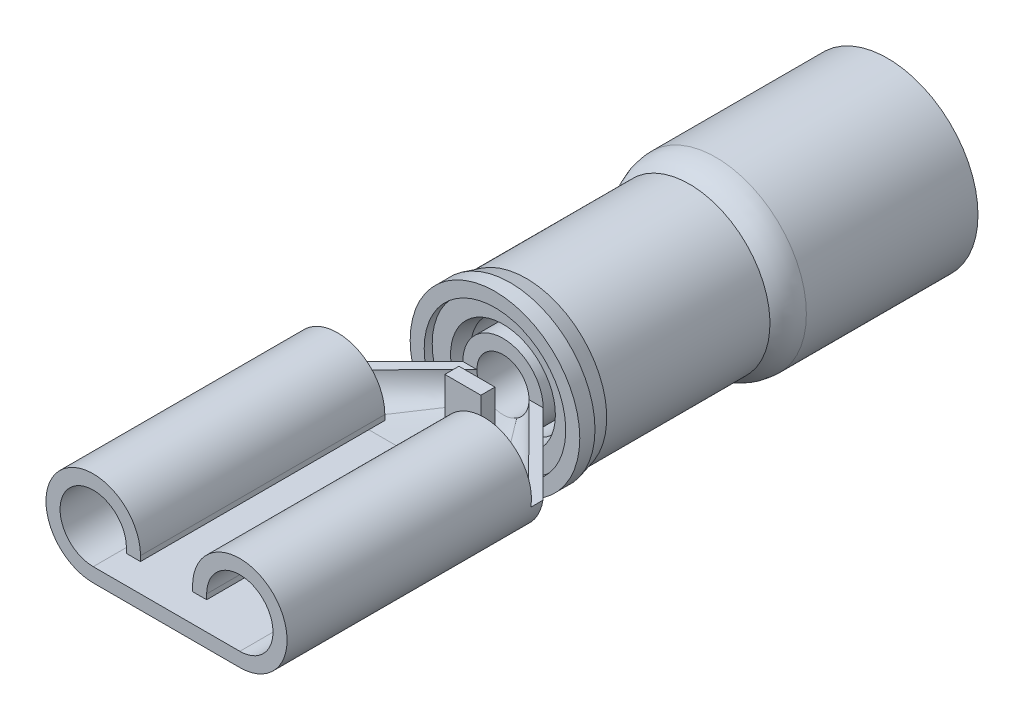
ISO-10303-21;
HEADER;
FILE_DESCRIPTION(('STEP AP214'),'2;1');
FILE_NAME('part.step','',(''),(''),'','','');
FILE_SCHEMA(('AUTOMOTIVE_DESIGN { 1 0 10303 214 1 1 1 1 }'));
ENDSEC;
DATA;
#1=APPLICATION_CONTEXT('core data for automotive mechanical design processes');
#2=APPLICATION_PROTOCOL_DEFINITION('international standard','automotive_design',2000,#1);
#3=PRODUCT_CONTEXT('',#1,'mechanical');
#4=PRODUCT('Part','Part','',(#3));
#5=PRODUCT_RELATED_PRODUCT_CATEGORY('part','',(#4));
#6=PRODUCT_DEFINITION_FORMATION('','',#4);
#7=PRODUCT_DEFINITION_CONTEXT('part definition',#1,'design');
#8=PRODUCT_DEFINITION('design','',#6,#7);
#9=PRODUCT_DEFINITION_SHAPE('','',#8);
#10=(LENGTH_UNIT() NAMED_UNIT(*) SI_UNIT(.MILLI.,.METRE.));
#11=(NAMED_UNIT(*) PLANE_ANGLE_UNIT() SI_UNIT($,.RADIAN.));
#12=(NAMED_UNIT(*) SI_UNIT($,.STERADIAN.) SOLID_ANGLE_UNIT());
#13=UNCERTAINTY_MEASURE_WITH_UNIT(LENGTH_MEASURE(1.E-05),#10,'distance_accuracy_value','');
#14=(GEOMETRIC_REPRESENTATION_CONTEXT(3) GLOBAL_UNCERTAINTY_ASSIGNED_CONTEXT((#13)) GLOBAL_UNIT_ASSIGNED_CONTEXT((#10,
#11,#12)) REPRESENTATION_CONTEXT('',''));
#15=CARTESIAN_POINT('',(0.,0.,0.));
#16=DIRECTION('',(0.,0.,1.));
#17=DIRECTION('',(1.,0.,0.));
#18=AXIS2_PLACEMENT_3D('',#15,#16,#17);
#19=CARTESIAN_POINT('',(0.,1.27254,-10.6680000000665));
#20=DIRECTION('',(0.,0.,1.));
#21=DIRECTION('',(1.,0.,0.));
#22=AXIS2_PLACEMENT_3D('',#19,#20,#21);
#23=CONICAL_SURFACE('',#22,1.66138818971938,0.261799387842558);
#24=CARTESIAN_POINT('',(0.,1.27254,-11.176));
#25=DIRECTION('',(0.,0.,-1.));
#26=DIRECTION('',(-1.,0.,0.));
#27=AXIS2_PLACEMENT_3D('',#24,#25,#26);
#28=CIRCLE('',#27,1.52527);
#29=CARTESIAN_POINT('',(-1.52527,1.27254,-11.176));
#30=VERTEX_POINT('',#29);
#31=EDGE_CURVE('P0_E30',#30,#30,#28,.T.);
#32=ORIENTED_EDGE('',*,*,#31,.T.);
#33=EDGE_LOOP('',(#32));
#34=FACE_BOUND('',#33,.T.);
#35=CARTESIAN_POINT('',(0.,1.27254,-10.6679999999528));
#36=DIRECTION('',(0.,0.,1.));
#37=DIRECTION('',(1.,0.,0.));
#38=AXIS2_PLACEMENT_3D('',#35,#36,#37);
#39=CIRCLE('',#38,1.66138818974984);
#40=CARTESIAN_POINT('',(1.66138818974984,1.27254,-10.6679999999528));
#41=VERTEX_POINT('',#40);
#42=EDGE_CURVE('P0_E17',#41,#41,#39,.T.);
#43=ORIENTED_EDGE('',*,*,#42,.T.);
#44=EDGE_LOOP('',(#43));
#45=FACE_BOUND('',#44,.T.);
#46=ADVANCED_FACE('P0_F14',(#34,#45),#23,.F.);
#47=CARTESIAN_POINT('',(0.,1.27254,-10.220325));
#48=DIRECTION('',(0.,0.,-1.));
#49=DIRECTION('',(-1.,0.,0.));
#50=AXIS2_PLACEMENT_3D('',#47,#48,#49);
#51=CYLINDRICAL_SURFACE('',#50,1.52527);
#52=CARTESIAN_POINT('',(0.,1.27254,-16.0146999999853));
#53=DIRECTION('',(0.,0.,1.));
#54=DIRECTION('',(0.,1.,0.));
#55=AXIS2_PLACEMENT_3D('',#52,#53,#54);
#56=CIRCLE('',#55,1.52527000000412);
#57=CARTESIAN_POINT('',(0.,2.79781000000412,-16.0146999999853));
#58=VERTEX_POINT('',#57);
#59=EDGE_CURVE('P0_E53',#58,#58,#56,.F.);
#60=ORIENTED_EDGE('',*,*,#59,.T.);
#61=EDGE_LOOP('',(#60));
#62=FACE_BOUND('',#61,.T.);
#63=ORIENTED_EDGE('',*,*,#31,.F.);
#64=EDGE_LOOP('',(#63));
#65=FACE_BOUND('',#64,.T.);
#66=ADVANCED_FACE('P0_F86',(#62,#65),#51,.F.);
#67=CARTESIAN_POINT('',(0.,1.27254,-10.668));
#68=DIRECTION('',(0.,0.,-1.));
#69=DIRECTION('',(-1.,0.,0.));
#70=AXIS2_PLACEMENT_3D('',#67,#68,#69);
#71=PLANE('',#70);
#72=ORIENTED_EDGE('',*,*,#42,.F.);
#73=EDGE_LOOP('',(#72));
#74=FACE_BOUND('',#73,.T.);
#75=CARTESIAN_POINT('',(0.,1.27254,-10.668));
#76=DIRECTION('',(0.,0.,-1.));
#77=DIRECTION('',(-1.,0.,0.));
#78=AXIS2_PLACEMENT_3D('',#75,#76,#77);
#79=CIRCLE('',#78,2.244318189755);
#80=CARTESIAN_POINT('',(-2.244318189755,1.27254,-10.668));
#81=VERTEX_POINT('',#80);
#82=EDGE_CURVE('P0_E51',#81,#81,#79,.F.);
#83=ORIENTED_EDGE('',*,*,#82,.T.);
#84=EDGE_LOOP('',(#83));
#85=FACE_BOUND('',#84,.T.);
#86=ADVANCED_FACE('P0_F83',(#74,#85),#71,.F.);
#87=CARTESIAN_POINT('',(0.,1.27254,-16.0146999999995));
#88=DIRECTION('',(0.,0.,1.));
#89=DIRECTION('',(1.,0.,0.));
#90=AXIS2_PLACEMENT_3D('',#87,#88,#89);
#91=CONICAL_SURFACE('',#90,1.52526999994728,1.35263017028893);
#92=CARTESIAN_POINT('',(0.,1.27254,-16.1274390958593));
#93=DIRECTION('',(0.,0.,-1.));
#94=DIRECTION('',(0.,-1.,0.));
#95=AXIS2_PLACEMENT_3D('',#92,#93,#94);
#96=CIRCLE('',#95,1.01673680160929);
#97=CARTESIAN_POINT('',(0.,0.255803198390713,-16.1274390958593));
#98=VERTEX_POINT('',#97);
#99=EDGE_CURVE('P0_E50',#98,#98,#96,.F.);
#100=ORIENTED_EDGE('',*,*,#99,.F.);
#101=EDGE_LOOP('',(#100));
#102=FACE_BOUND('',#101,.T.);
#103=ORIENTED_EDGE('',*,*,#59,.F.);
#104=EDGE_LOOP('',(#103));
#105=FACE_BOUND('',#104,.T.);
#106=ADVANCED_FACE('P0_F79',(#102,#105),#91,.F.);
#107=CARTESIAN_POINT('',(0.,1.27254,-9.7917));
#108=DIRECTION('',(0.,0.,-1.));
#109=DIRECTION('',(-1.,0.,0.));
#110=AXIS2_PLACEMENT_3D('',#107,#108,#109);
#111=CYLINDRICAL_SURFACE('',#110,2.244318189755);
#112=CARTESIAN_POINT('',(0.,1.27254,-10.414));
#113=DIRECTION('',(0.,0.,-1.));
#114=DIRECTION('',(-1.,0.,0.));
#115=AXIS2_PLACEMENT_3D('',#112,#113,#114);
#116=CIRCLE('',#115,2.244318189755);
#117=CARTESIAN_POINT('',(-2.244318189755,1.27254,-10.414));
#118=VERTEX_POINT('',#117);
#119=EDGE_CURVE('P0_E48',#118,#118,#116,.F.);
#120=ORIENTED_EDGE('',*,*,#119,.T.);
#121=EDGE_LOOP('',(#120));
#122=FACE_BOUND('',#121,.T.);
#123=ORIENTED_EDGE('',*,*,#82,.F.);
#124=EDGE_LOOP('',(#123));
#125=FACE_BOUND('',#124,.T.);
#126=ADVANCED_FACE('P0_F74',(#122,#125),#111,.F.);
#127=CARTESIAN_POINT('',(0.,1.27254,-16.43631893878));
#128=DIRECTION('',(0.,0.,-1.));
#129=DIRECTION('',(0.,-1.,0.));
#130=AXIS2_PLACEMENT_3D('',#127,#128,#129);
#131=TOROIDAL_SURFACE('',#130,1.35382,0.4572);
#132=CARTESIAN_POINT('',(0.,1.27254,-16.7451987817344));
#133=DIRECTION('',(0.,0.,-1.));
#134=DIRECTION('',(0.,-1.,0.));
#135=AXIS2_PLACEMENT_3D('',#132,#133,#134);
#136=CIRCLE('',#135,1.01673680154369);
#137=CARTESIAN_POINT('',(0.,0.255803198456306,-16.7451987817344));
#138=VERTEX_POINT('',#137);
#139=EDGE_CURVE('P0_E47',#138,#138,#136,.T.);
#140=ORIENTED_EDGE('',*,*,#139,.T.);
#141=EDGE_LOOP('',(#140));
#142=FACE_BOUND('',#141,.T.);
#143=ORIENTED_EDGE('',*,*,#99,.T.);
#144=EDGE_LOOP('',(#143));
#145=FACE_BOUND('',#144,.T.);
#146=ADVANCED_FACE('P0_F69',(#142,#145),#131,.T.);
#147=CARTESIAN_POINT('',(0.,1.27254,-10.414));
#148=DIRECTION('',(0.,0.,-1.));
#149=DIRECTION('',(-1.,0.,0.));
#150=AXIS2_PLACEMENT_3D('',#147,#148,#149);
#151=PLANE('',#150);
#152=ORIENTED_EDGE('',*,*,#119,.F.);
#153=EDGE_LOOP('',(#152));
#154=FACE_BOUND('',#153,.T.);
#155=CARTESIAN_POINT('',(0.,1.27254,-10.414));
#156=DIRECTION('',(0.,0.,-1.));
#157=DIRECTION('',(-1.,0.,0.));
#158=AXIS2_PLACEMENT_3D('',#155,#156,#157);
#159=CIRCLE('',#158,2.688818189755);
#160=CARTESIAN_POINT('',(-2.688818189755,1.27254,-10.414));
#161=VERTEX_POINT('',#160);
#162=EDGE_CURVE('P0_E43',#161,#161,#159,.T.);
#163=ORIENTED_EDGE('',*,*,#162,.F.);
#164=EDGE_LOOP('',(#163));
#165=FACE_BOUND('',#164,.T.);
#166=ADVANCED_FACE('P0_F73',(#154,#165),#151,.F.);
#167=CARTESIAN_POINT('',(0.,1.27254,-17.6452698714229));
#168=DIRECTION('',(0.,0.,-1.));
#169=DIRECTION('',(-1.,0.,0.));
#170=AXIS2_PLACEMENT_3D('',#167,#168,#169);
#171=CONICAL_SURFACE('',#170,1.84149999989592,0.741764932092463);
#172=CARTESIAN_POINT('',(0.,1.27254,-17.64526987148));
#173=DIRECTION('',(0.,0.,-1.));
#174=DIRECTION('',(-1.,0.,0.));
#175=AXIS2_PLACEMENT_3D('',#172,#173,#174);
#176=CIRCLE('',#175,1.8415);
#177=CARTESIAN_POINT('',(-1.8415,1.27254,-17.64526987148));
#178=VERTEX_POINT('',#177);
#179=EDGE_CURVE('P0_E46',#178,#178,#176,.T.);
#180=ORIENTED_EDGE('',*,*,#179,.T.);
#181=EDGE_LOOP('',(#180));
#182=FACE_BOUND('',#181,.T.);
#183=ORIENTED_EDGE('',*,*,#139,.F.);
#184=EDGE_LOOP('',(#183));
#185=FACE_BOUND('',#184,.T.);
#186=ADVANCED_FACE('P0_F124',(#182,#185),#171,.F.);
#187=CARTESIAN_POINT('',(0.,1.27254,-9.7917));
#188=DIRECTION('',(0.,0.,-1.));
#189=DIRECTION('',(-1.,0.,0.));
#190=AXIS2_PLACEMENT_3D('',#187,#188,#189);
#191=CYLINDRICAL_SURFACE('',#190,2.688818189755);
#192=CARTESIAN_POINT('',(0.,1.27254,-10.8966000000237));
#193=DIRECTION('',(0.,0.,1.));
#194=DIRECTION('',(0.,1.,0.));
#195=AXIS2_PLACEMENT_3D('',#192,#193,#194);
#196=CIRCLE('',#195,2.6888181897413);
#197=CARTESIAN_POINT('',(0.,3.9613581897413,-10.8966000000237));
#198=VERTEX_POINT('',#197);
#199=EDGE_CURVE('P0_E42',#198,#198,#196,.F.);
#200=ORIENTED_EDGE('',*,*,#199,.F.);
#201=EDGE_LOOP('',(#200));
#202=FACE_BOUND('',#201,.T.);
#203=ORIENTED_EDGE('',*,*,#162,.T.);
#204=EDGE_LOOP('',(#203));
#205=FACE_BOUND('',#204,.T.);
#206=ADVANCED_FACE('P0_F130',(#202,#205),#191,.T.);
#207=CARTESIAN_POINT('',(0.,1.27254,-10.220325));
#208=DIRECTION('',(0.,0.,-1.));
#209=DIRECTION('',(-1.,0.,0.));
#210=AXIS2_PLACEMENT_3D('',#207,#208,#209);
#211=CYLINDRICAL_SURFACE('',#210,1.8415);
#212=CARTESIAN_POINT('',(0.,1.27254,-19.6215));
#213=DIRECTION('',(0.,0.,-1.));
#214=DIRECTION('',(-1.,0.,0.));
#215=AXIS2_PLACEMENT_3D('',#212,#213,#214);
#216=CIRCLE('',#215,1.8415);
#217=CARTESIAN_POINT('',(-1.8415,1.27254,-19.6215));
#218=VERTEX_POINT('',#217);
#219=EDGE_CURVE('P0_E39',#218,#218,#216,.F.);
#220=ORIENTED_EDGE('',*,*,#219,.F.);
#221=EDGE_LOOP('',(#220));
#222=FACE_BOUND('',#221,.T.);
#223=ORIENTED_EDGE('',*,*,#179,.F.);
#224=EDGE_LOOP('',(#223));
#225=FACE_BOUND('',#224,.T.);
#226=ADVANCED_FACE('P0_F127',(#222,#225),#211,.F.);
#227=CARTESIAN_POINT('',(0.,1.27254,-10.8966000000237));
#228=DIRECTION('',(0.,0.,1.));
#229=DIRECTION('',(1.,0.,0.));
#230=AXIS2_PLACEMENT_3D('',#227,#228,#229);
#231=CONICAL_SURFACE('',#230,2.6888181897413,0.261799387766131);
#232=CARTESIAN_POINT('',(0.,1.27254,-11.4046));
#233=DIRECTION('',(0.,0.,-1.));
#234=DIRECTION('',(-1.,0.,0.));
#235=AXIS2_PLACEMENT_3D('',#232,#233,#234);
#236=CIRCLE('',#235,2.5527);
#237=CARTESIAN_POINT('',(-2.5527,1.27254,-11.4046));
#238=VERTEX_POINT('',#237);
#239=EDGE_CURVE('P0_E38',#238,#238,#236,.T.);
#240=ORIENTED_EDGE('',*,*,#239,.F.);
#241=EDGE_LOOP('',(#240));
#242=FACE_BOUND('',#241,.T.);
#243=ORIENTED_EDGE('',*,*,#199,.T.);
#244=EDGE_LOOP('',(#243));
#245=FACE_BOUND('',#244,.T.);
#246=ADVANCED_FACE('P0_F129',(#242,#245),#231,.T.);
#247=CARTESIAN_POINT('',(0.,1.27254,-19.6215));
#248=DIRECTION('',(0.,0.,-1.));
#249=DIRECTION('',(-1.,0.,0.));
#250=AXIS2_PLACEMENT_3D('',#247,#248,#249);
#251=PLANE('',#250);
#252=ORIENTED_EDGE('',*,*,#219,.T.);
#253=EDGE_LOOP('',(#252));
#254=FACE_BOUND('',#253,.T.);
#255=CARTESIAN_POINT('',(0.,1.27254,-19.6215));
#256=DIRECTION('',(0.,0.,-1.));
#257=DIRECTION('',(-1.,0.,0.));
#258=AXIS2_PLACEMENT_3D('',#255,#256,#257);
#259=CIRCLE('',#258,2.42443);
#260=CARTESIAN_POINT('',(-2.42443,1.27254,-19.6215));
#261=VERTEX_POINT('',#260);
#262=EDGE_CURVE('P0_E35',#261,#261,#259,.T.);
#263=ORIENTED_EDGE('',*,*,#262,.T.);
#264=EDGE_LOOP('',(#263));
#265=FACE_BOUND('',#264,.T.);
#266=ADVANCED_FACE('P0_F137',(#254,#265),#251,.T.);
#267=CARTESIAN_POINT('',(0.,1.27254,-9.7917));
#268=DIRECTION('',(0.,0.,-1.));
#269=DIRECTION('',(-1.,0.,0.));
#270=AXIS2_PLACEMENT_3D('',#267,#268,#269);
#271=CYLINDRICAL_SURFACE('',#270,2.5527);
#272=CARTESIAN_POINT('',(0.,1.27254,-16.5799969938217));
#273=DIRECTION('',(0.,0.,-1.));
#274=DIRECTION('',(0.,-1.,0.));
#275=AXIS2_PLACEMENT_3D('',#272,#273,#274);
#276=CIRCLE('',#275,2.55269999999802);
#277=CARTESIAN_POINT('',(0.,-1.28015999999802,-16.5799969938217));
#278=VERTEX_POINT('',#277);
#279=EDGE_CURVE('P0_E34',#278,#278,#276,.T.);
#280=ORIENTED_EDGE('',*,*,#279,.F.);
#281=EDGE_LOOP('',(#280));
#282=FACE_BOUND('',#281,.T.);
#283=ORIENTED_EDGE('',*,*,#239,.T.);
#284=EDGE_LOOP('',(#283));
#285=FACE_BOUND('',#284,.T.);
#286=ADVANCED_FACE('P0_F202',(#282,#285),#271,.T.);
#287=CARTESIAN_POINT('',(0.,1.27254,-9.7917));
#288=DIRECTION('',(0.,0.,-1.));
#289=DIRECTION('',(-1.,0.,0.));
#290=AXIS2_PLACEMENT_3D('',#287,#288,#289);
#291=CYLINDRICAL_SURFACE('',#290,2.42443);
#292=CARTESIAN_POINT('',(0.,1.27254,-22.86));
#293=DIRECTION('',(0.,0.,-1.));
#294=DIRECTION('',(-1.,0.,0.));
#295=AXIS2_PLACEMENT_3D('',#292,#293,#294);
#296=CIRCLE('',#295,2.42443);
#297=CARTESIAN_POINT('',(-2.42443,1.27254,-22.86));
#298=VERTEX_POINT('',#297);
#299=EDGE_CURVE('P0_E26',#298,#298,#296,.F.);
#300=ORIENTED_EDGE('',*,*,#299,.F.);
#301=EDGE_LOOP('',(#300));
#302=FACE_BOUND('',#301,.T.);
#303=ORIENTED_EDGE('',*,*,#262,.F.);
#304=EDGE_LOOP('',(#303));
#305=FACE_BOUND('',#304,.T.);
#306=ADVANCED_FACE('P0_F110',(#302,#305),#291,.F.);
#307=CARTESIAN_POINT('',(0.,1.27254,-17.41858079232));
#308=DIRECTION('',(0.,0.,-1.));
#309=DIRECTION('',(0.,-1.,0.));
#310=AXIS2_PLACEMENT_3D('',#307,#308,#309);
#311=TOROIDAL_SURFACE('',#310,1.59893,1.27);
#312=CARTESIAN_POINT('',(0.,1.27254,-17.41858079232));
#313=DIRECTION('',(0.,0.,-1.));
#314=DIRECTION('',(-1.,0.,0.));
#315=AXIS2_PLACEMENT_3D('',#312,#313,#314);
#316=CIRCLE('',#315,2.86893);
#317=CARTESIAN_POINT('',(-2.86893,1.27254,-17.41858079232));
#318=VERTEX_POINT('',#317);
#319=EDGE_CURVE('P0_E21',#318,#318,#316,.T.);
#320=ORIENTED_EDGE('',*,*,#319,.F.);
#321=EDGE_LOOP('',(#320));
#322=FACE_BOUND('',#321,.T.);
#323=ORIENTED_EDGE('',*,*,#279,.T.);
#324=EDGE_LOOP('',(#323));
#325=FACE_BOUND('',#324,.T.);
#326=ADVANCED_FACE('P0_F102',(#322,#325),#311,.T.);
#327=CARTESIAN_POINT('',(0.,1.27254,-22.86));
#328=DIRECTION('',(0.,0.,-1.));
#329=DIRECTION('',(-1.,0.,0.));
#330=AXIS2_PLACEMENT_3D('',#327,#328,#329);
#331=PLANE('',#330);
#332=ORIENTED_EDGE('',*,*,#299,.T.);
#333=EDGE_LOOP('',(#332));
#334=FACE_BOUND('',#333,.T.);
#335=CARTESIAN_POINT('',(0.,1.27254,-22.86));
#336=DIRECTION('',(0.,0.,-1.));
#337=DIRECTION('',(-1.,0.,0.));
#338=AXIS2_PLACEMENT_3D('',#335,#336,#337);
#339=CIRCLE('',#338,2.86893);
#340=CARTESIAN_POINT('',(-2.86893,1.27254,-22.86));
#341=VERTEX_POINT('',#340);
#342=EDGE_CURVE('P0_E10',#341,#341,#339,.F.);
#343=ORIENTED_EDGE('',*,*,#342,.F.);
#344=EDGE_LOOP('',(#343));
#345=FACE_BOUND('',#344,.T.);
#346=ADVANCED_FACE('P0_F97',(#334,#345),#331,.T.);
#347=CARTESIAN_POINT('',(0.,1.27254,-9.7917));
#348=DIRECTION('',(0.,0.,-1.));
#349=DIRECTION('',(-1.,0.,0.));
#350=AXIS2_PLACEMENT_3D('',#347,#348,#349);
#351=CYLINDRICAL_SURFACE('',#350,2.86893);
#352=ORIENTED_EDGE('',*,*,#342,.T.);
#353=EDGE_LOOP('',(#352));
#354=FACE_BOUND('',#353,.T.);
#355=ORIENTED_EDGE('',*,*,#319,.T.);
#356=EDGE_LOOP('',(#355));
#357=FACE_BOUND('',#356,.T.);
#358=ADVANCED_FACE('P0_F95',(#354,#357),#351,.T.);
#359=CLOSED_SHELL('',(#46,#66,#86,#106,#126,#146,#166,#186,#206,#226,#246,#266,#286,#306,#326,
#346,#358));
#360=MANIFOLD_SOLID_BREP('P0_B1',#359);
#361=CARTESIAN_POINT('',(0.,1.27254,-16.13535));
#362=DIRECTION('',(0.,0.,1.));
#363=DIRECTION('',(1.,0.,0.));
#364=AXIS2_PLACEMENT_3D('',#361,#362,#363);
#365=CYLINDRICAL_SURFACE('',#364,1.27254);
#366=CARTESIAN_POINT('',(0.,1.27254,-15.875));
#367=DIRECTION('',(0.,0.,1.));
#368=DIRECTION('',(1.,0.,0.));
#369=AXIS2_PLACEMENT_3D('',#366,#367,#368);
#370=CIRCLE('',#369,1.27254);
#371=CARTESIAN_POINT('',(1.27254,1.27254,-15.875));
#372=VERTEX_POINT('',#371);
#373=EDGE_CURVE('P1_E222',#372,#372,#370,.T.);
#374=ORIENTED_EDGE('',*,*,#373,.T.);
#375=EDGE_LOOP('',(#374));
#376=FACE_BOUND('',#375,.T.);
#377=CARTESIAN_POINT('',(1.27254,1.27253999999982,-10.6679999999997));
#378=CARTESIAN_POINT('',(1.27253974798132,1.2367392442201,-10.6679908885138));
#379=CARTESIAN_POINT('',(1.27102825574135,1.20095565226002,-10.667989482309));
#380=CARTESIAN_POINT('',(1.26499827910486,1.12964446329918,-10.6679923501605));
#381=CARTESIAN_POINT('',(1.26047993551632,1.09411685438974,-10.6679966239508));
#382=CARTESIAN_POINT('',(1.24245626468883,0.988354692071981,-10.6680033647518));
#383=CARTESIAN_POINT('',(1.22448218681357,0.918828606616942,-10.6679997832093));
#384=CARTESIAN_POINT('',(1.17711911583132,0.783788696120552,-10.6679971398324));
#385=CARTESIAN_POINT('',(1.14772554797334,0.718276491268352,-10.6679980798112));
#386=CARTESIAN_POINT('',(1.07835675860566,0.593114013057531,-10.6679984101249));
#387=CARTESIAN_POINT('',(1.0383827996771,0.533463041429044,-10.6679978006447));
#388=CARTESIAN_POINT('',(0.948983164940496,0.421708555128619,-10.6679978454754));
#389=CARTESIAN_POINT('',(0.899554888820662,0.369607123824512,-10.6679985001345));
#390=CARTESIAN_POINT('',(0.792648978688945,0.274452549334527,-10.6679934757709));
#391=CARTESIAN_POINT('',(0.735174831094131,0.231395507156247,-10.6679877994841));
#392=CARTESIAN_POINT('',(0.636574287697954,0.169752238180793,-10.6679925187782));
#393=CARTESIAN_POINT('',(0.597367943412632,0.1480350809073,-10.6679976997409));
#394=CARTESIAN_POINT('',(0.5169596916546,0.108878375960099,-10.6680042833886));
#395=CARTESIAN_POINT('',(0.475761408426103,0.0914313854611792,-10.6680056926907));
#396=CARTESIAN_POINT('',(0.433738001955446,0.0761999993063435,-10.6679999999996));
#397=B_SPLINE_CURVE_WITH_KNOTS('',3,(#377,#378,#379,#380,#381,#382,#383,#384,#385,#386,#387,
#388,#389,#390,#391,#392,#393,#394,#395,#396),.UNSPECIFIED.,.F.,.F.,(4,2,2,2,2,2,2,2,2,4),(0.,
0.107336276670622,0.214667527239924,0.428997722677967,0.643413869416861,0.85780444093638,
1.07225406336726,1.28661104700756,1.42083991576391,1.55483313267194),.UNSPECIFIED.);
#398=CARTESIAN_POINT('',(1.27253999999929,1.27253999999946,-10.668));
#399=VERTEX_POINT('',#398);
#400=CARTESIAN_POINT('',(0.433733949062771,0.0762111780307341,-10.668083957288));
#401=VERTEX_POINT('',#400);
#402=EDGE_CURVE('P1_E240',#399,#401,#397,.T.);
#403=ORIENTED_EDGE('',*,*,#402,.T.);
#404=CARTESIAN_POINT('',(-0.447927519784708,0.0814639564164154,-10.6680858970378));
#405=CARTESIAN_POINT('',(-0.443134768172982,0.079663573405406,-10.6680858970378));
#406=CARTESIAN_POINT('',(-0.38941872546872,0.0598408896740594,-10.6680858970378));
#407=CARTESIAN_POINT('',(-0.296780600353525,0.0330486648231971,-10.6680858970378));
#408=CARTESIAN_POINT('',(-0.185464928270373,0.0121733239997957,-10.6680858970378));
#409=CARTESIAN_POINT('',(-0.0889575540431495,0.00201312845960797,-10.6680858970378));
#410=CARTESIAN_POINT('',(0.,-0.00100656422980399,-10.6680858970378));
#411=CARTESIAN_POINT('',(0.0889575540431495,0.00201312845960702,-10.6680858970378));
#412=CARTESIAN_POINT('',(0.185464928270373,0.0121733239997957,-10.6680858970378));
#413=CARTESIAN_POINT('',(0.296780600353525,0.0330486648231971,-10.6680858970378));
#414=CARTESIAN_POINT('',(0.389328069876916,0.0598146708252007,-10.6680858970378));
#415=CARTESIAN_POINT('',(0.44293381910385,0.0795894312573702,-10.6680858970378));
#416=CARTESIAN_POINT('',(0.447623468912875,0.0813497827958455,-10.6680858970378));
#417=B_SPLINE_CURVE_WITH_KNOTS('',3,(#404,#405,#406,#407,#408,#409,#410,#411,#412,#413,#414,
#415,#416),.UNSPECIFIED.,.F.,.F.,(4,1,1,1,1,1,1,1,1,1,4),(-0.01187173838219,
0.000256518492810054,0.12525651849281,0.25025651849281,0.37525651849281,0.50025651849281,
0.62525651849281,0.75025651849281,0.87525651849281,1.00025651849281,1.012128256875),.UNSPECIFIED.);
#418=CARTESIAN_POINT('',(0.0881707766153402,0.00305885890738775,-10.6680859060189));
#419=VERTEX_POINT('',#418);
#420=EDGE_CURVE('P1_E235',#401,#419,#417,.F.);
#421=ORIENTED_EDGE('',*,*,#420,.T.);
#422=CARTESIAN_POINT('',(-1.43903101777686E-13,0.,-10.6679999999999));
#423=CARTESIAN_POINT('',(0.00362614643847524,-3.02438430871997E-08,-10.6680035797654));
#424=CARTESIAN_POINT('',(0.00725229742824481,1.50450806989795E-05,-10.668007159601));
#425=CARTESIAN_POINT('',(0.0145090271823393,7.5907355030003E-05,-10.6680143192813));
#426=CARTESIAN_POINT('',(0.0181396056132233,0.000121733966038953,-10.66801789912));
#427=CARTESIAN_POINT('',(0.0254097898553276,0.00024476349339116,-10.6680250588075));
#428=CARTESIAN_POINT('',(0.029049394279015,0.000322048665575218,-10.6680286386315));
#429=CARTESIAN_POINT('',(0.0363422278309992,0.000508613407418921,-10.6680357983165));
#430=CARTESIAN_POINT('',(0.0399954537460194,0.000618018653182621,-10.6680393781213));
#431=CARTESIAN_POINT('',(0.047320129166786,0.000869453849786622,-10.6680465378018));
#432=CARTESIAN_POINT('',(0.0509915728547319,0.00101165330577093,-10.6680501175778));
#433=CARTESIAN_POINT('',(0.0583572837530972,0.0013293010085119,-10.6680572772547));
#434=CARTESIAN_POINT('',(0.0620515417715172,0.00150496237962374,-10.6680608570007));
#435=CARTESIAN_POINT('',(0.0694674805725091,0.00189017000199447,-10.6680680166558));
#436=CARTESIAN_POINT('',(0.0731891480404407,0.00209997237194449,-10.6680715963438));
#437=CARTESIAN_POINT('',(0.0806645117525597,0.00255405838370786,-10.6680787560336));
#438=CARTESIAN_POINT('',(0.0844181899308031,0.00279863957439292,-10.6680823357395));
#439=CARTESIAN_POINT('',(0.0881707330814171,0.00305948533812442,-10.6680858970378));
#440=B_SPLINE_CURVE_WITH_KNOTS('',3,(#422,#423,#424,#425,#426,#427,#428,#429,#430,#431,#432,
#433,#434,#435,#436,#437,#438,#439),.UNSPECIFIED.,.F.,.F.,(4,2,2,2,2,2,2,2,4),(0.,
0.0108784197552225,0.0217708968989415,0.0326920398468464,0.04365649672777,0.0546789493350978,
0.0657741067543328,0.0769566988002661,0.0882414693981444),.UNSPECIFIED.);
#441=CARTESIAN_POINT('',(0.,0.,-10.668));
#442=VERTEX_POINT('',#441);
#443=EDGE_CURVE('P1_E208',#419,#442,#440,.F.);
#444=ORIENTED_EDGE('',*,*,#443,.T.);
#445=CARTESIAN_POINT('',(0.,0.,-10.668));
#446=CARTESIAN_POINT('',(-0.00369534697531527,-4.38518093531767E-10,-10.6680079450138));
#447=CARTESIAN_POINT('',(-0.00739069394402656,1.60964401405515E-05,-10.6680158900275));
#448=CARTESIAN_POINT('',(-0.0147811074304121,8.04816838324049E-05,-10.668031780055));
#449=CARTESIAN_POINT('',(-0.0184761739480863,0.00012877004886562,-10.6680397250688));
#450=CARTESIAN_POINT('',(-0.025865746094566,0.000257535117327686,-10.6680556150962));
#451=CARTESIAN_POINT('',(-0.0295602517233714,0.000338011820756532,-10.66806356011));
#452=CARTESIAN_POINT('',(-0.0369484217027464,0.00053114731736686,-10.6680794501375));
#453=CARTESIAN_POINT('',(-0.0406420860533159,0.000643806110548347,-10.6680873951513));
#454=CARTESIAN_POINT('',(-0.048028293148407,0.00090129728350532,-10.6681032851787));
#455=CARTESIAN_POINT('',(-0.0517208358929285,0.00104612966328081,-10.6681112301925));
#456=CARTESIAN_POINT('',(-0.0591045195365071,0.0013679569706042,-10.66812712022));
#457=CARTESIAN_POINT('',(-0.0627956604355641,0.0015449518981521,-10.6681350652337));
#458=CARTESIAN_POINT('',(-0.0701762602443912,0.00193109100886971,-10.6681509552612));
#459=CARTESIAN_POINT('',(-0.0738657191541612,0.00214023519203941,-10.668158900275));
#460=CARTESIAN_POINT('',(-0.0812426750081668,0.00259065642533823,-10.6681747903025));
#461=CARTESIAN_POINT('',(-0.0849301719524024,0.00283193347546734,-10.6681827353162));
#462=CARTESIAN_POINT('',(-0.0886165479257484,0.00308926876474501,-10.66819068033));
#463=B_SPLINE_CURVE_WITH_KNOTS('',3,(#445,#446,#447,#448,#449,#450,#451,#452,#453,#454,#455,
#456,#457,#458,#459,#460,#461,#462),.UNSPECIFIED.,.F.,.F.,(4,2,2,2,2,2,2,2,4),(0.,
0.0110860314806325,0.0221720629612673,0.0332580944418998,0.0443441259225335,0.0554301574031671,
0.0665161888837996,0.0776022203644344,0.0886882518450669),.UNSPECIFIED.);
#464=CARTESIAN_POINT('',(-0.0886166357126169,0.00309020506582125,-10.6681906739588));
#465=VERTEX_POINT('',#464);
#466=EDGE_CURVE('P1_E951',#442,#465,#463,.T.);
#467=ORIENTED_EDGE('',*,*,#466,.T.);
#468=CARTESIAN_POINT('',(-0.433738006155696,0.0762000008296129,-10.6679999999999));
#469=CARTESIAN_POINT('',(-0.419564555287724,0.0710607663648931,-10.668006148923));
#470=CARTESIAN_POINT('',(-0.405300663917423,0.0661696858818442,-10.6680124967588));
#471=CARTESIAN_POINT('',(-0.377513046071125,0.0571923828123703,-10.668025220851));
#472=CARTESIAN_POINT('',(-0.363999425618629,0.0530748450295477,-10.668031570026));
#473=CARTESIAN_POINT('',(-0.337667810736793,0.0455395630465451,-10.6680442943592));
#474=CARTESIAN_POINT('',(-0.324857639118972,0.0420944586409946,-10.668050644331));
#475=CARTESIAN_POINT('',(-0.29989099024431,0.0357882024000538,-10.6680633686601));
#476=CARTESIAN_POINT('',(-0.287740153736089,0.0329046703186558,-10.6680697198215));
#477=CARTESIAN_POINT('',(-0.264038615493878,0.0276432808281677,-10.6680824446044));
#478=CARTESIAN_POINT('',(-0.25249218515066,0.0252462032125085,-10.6680887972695));
#479=CARTESIAN_POINT('',(-0.229941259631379,0.0208973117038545,-10.6681015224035));
#480=CARTESIAN_POINT('',(-0.218939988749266,0.0189287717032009,-10.6681078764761));
#481=CARTESIAN_POINT('',(-0.197422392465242,0.0153691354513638,-10.6681206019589));
#482=CARTESIAN_POINT('',(-0.186908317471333,0.0137643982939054,-10.668126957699));
#483=CARTESIAN_POINT('',(-0.166304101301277,0.010877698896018,-10.6681396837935));
#484=CARTESIAN_POINT('',(-0.156215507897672,0.00958469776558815,-10.6681460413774));
#485=CARTESIAN_POINT('',(-0.136396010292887,0.00729046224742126,-10.6681587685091));
#486=CARTESIAN_POINT('',(-0.126666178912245,0.00627996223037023,-10.6681651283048));
#487=CARTESIAN_POINT('',(-0.107498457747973,0.00451357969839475,-10.6681778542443));
#488=CARTESIAN_POINT('',(-0.0980612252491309,0.00375056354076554,-10.6681842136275));
#489=CARTESIAN_POINT('',(-0.088616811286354,0.00309207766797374,-10.6681906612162));
#490=B_SPLINE_CURVE_WITH_KNOTS('',3,(#468,#469,#470,#471,#472,#473,#474,#475,#476,#477,#478,
#479,#480,#481,#482,#483,#484,#485,#486,#487,#488,#489),.UNSPECIFIED.,.F.,.F.,(4,2,2,2,2,2,2,2,
2,2,4),(0.,0.0452275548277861,0.0876005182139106,0.127389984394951,0.164849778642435,
0.200223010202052,0.233747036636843,0.265651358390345,0.296161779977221,0.325505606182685,
0.35390724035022),.UNSPECIFIED.);
#491=CARTESIAN_POINT('',(-0.433738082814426,0.0761997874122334,-10.6679991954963));
#492=VERTEX_POINT('',#491);
#493=EDGE_CURVE('P1_E204',#465,#492,#490,.F.);
#494=ORIENTED_EDGE('',*,*,#493,.T.);
#495=CARTESIAN_POINT('',(-0.433738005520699,0.0762000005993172,-10.6680000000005));
#496=CARTESIAN_POINT('',(-0.467394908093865,0.0884027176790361,-10.6680041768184));
#497=CARTESIAN_POINT('',(-0.500520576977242,0.102020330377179,-10.6680021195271));
#498=CARTESIAN_POINT('',(-0.565506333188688,0.131995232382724,-10.667994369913));
#499=CARTESIAN_POINT('',(-0.597366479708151,0.14835239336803,-10.6679886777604));
#500=CARTESIAN_POINT('',(-0.690652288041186,0.201345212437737,-10.6679794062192));
#501=CARTESIAN_POINT('',(-0.749888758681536,0.241940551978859,-10.667983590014));
#502=CARTESIAN_POINT('',(-0.860699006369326,0.332495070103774,-10.6679873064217));
#503=CARTESIAN_POINT('',(-0.912269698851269,0.382457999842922,-10.6679868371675));
#504=CARTESIAN_POINT('',(-1.00629347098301,0.49033387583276,-10.667986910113));
#505=CARTESIAN_POINT('',(-1.04874763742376,0.548245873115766,-10.6679874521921));
#506=CARTESIAN_POINT('',(-1.1233388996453,0.670383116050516,-10.6679884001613));
#507=CARTESIAN_POINT('',(-1.15547314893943,0.734610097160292,-10.6679888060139));
#508=CARTESIAN_POINT('',(-1.20849159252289,0.867547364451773,-10.6679891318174));
#509=CARTESIAN_POINT('',(-1.22938064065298,0.936255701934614,-10.6679890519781));
#510=CARTESIAN_POINT('',(-1.25372527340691,1.04996279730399,-10.6679905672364));
#511=CARTESIAN_POINT('',(-1.2607787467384,1.09422363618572,-10.6679915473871));
#512=CARTESIAN_POINT('',(-1.27018404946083,1.18316338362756,-10.6679947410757));
#513=CARTESIAN_POINT('',(-1.27254411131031,1.22784142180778,-10.6679969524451));
#514=CARTESIAN_POINT('',(-1.27254,1.2725399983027,-10.6679999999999));
#515=B_SPLINE_CURVE_WITH_KNOTS('',3,(#495,#496,#497,#498,#499,#500,#501,#502,#503,#504,#505,
#506,#507,#508,#509,#510,#511,#512,#513,#514),.UNSPECIFIED.,.F.,.F.,(4,2,2,2,2,2,2,2,2,4),(0.,
0.107336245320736,0.214667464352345,0.428997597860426,0.643413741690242,0.857804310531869,
1.07225396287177,1.286610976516,1.4208398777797,1.55483312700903),.UNSPECIFIED.);
#516=CARTESIAN_POINT('',(-1.27253999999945,1.27253999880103,-10.668));
#517=VERTEX_POINT('',#516);
#518=EDGE_CURVE('P1_E201',#492,#517,#515,.T.);
#519=ORIENTED_EDGE('',*,*,#518,.T.);
#520=CARTESIAN_POINT('',(0.,1.27254,-10.668));
#521=DIRECTION('',(0.,0.,1.));
#522=DIRECTION('',(1.,0.,0.));
#523=AXIS2_PLACEMENT_3D('',#520,#521,#522);
#524=CIRCLE('',#523,1.27254);
#525=EDGE_CURVE('P1_E198',#399,#517,#524,.T.);
#526=ORIENTED_EDGE('',*,*,#525,.F.);
#527=EDGE_LOOP('',(#403,#421,#444,#467,#494,#519,#526));
#528=FACE_BOUND('',#527,.T.);
#529=ADVANCED_FACE('P1_F15',(#376,#528),#365,.T.);
#530=CARTESIAN_POINT('',(0.,1.27254,-10.668));
#531=DIRECTION('',(0.,0.,1.));
#532=DIRECTION('',(1.,0.,0.));
#533=AXIS2_PLACEMENT_3D('',#530,#531,#532);
#534=PLANE('',#533);
#535=CARTESIAN_POINT('',(0.,1.27254,-10.668));
#536=DIRECTION('',(0.,0.,1.));
#537=DIRECTION('',(1.,0.,0.));
#538=AXIS2_PLACEMENT_3D('',#535,#536,#537);
#539=CIRCLE('',#538,0.8255);
#540=CARTESIAN_POINT('',(-0.8255,1.272539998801,-10.6680000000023));
#541=VERTEX_POINT('',#540);
#542=CARTESIAN_POINT('',(0.8255,1.27254,-10.668));
#543=VERTEX_POINT('',#542);
#544=EDGE_CURVE('P1_E440',#541,#543,#539,.F.);
#545=ORIENTED_EDGE('',*,*,#544,.T.);
#546=DIRECTION('',(1.,0.,0.));
#547=VECTOR('',#546,1.);
#548=CARTESIAN_POINT('',(0.,1.27254,-10.668));
#549=LINE('',#548,#547);
#550=EDGE_CURVE('P1_E233',#543,#399,#549,.T.);
#551=ORIENTED_EDGE('',*,*,#550,.T.);
#552=ORIENTED_EDGE('',*,*,#525,.T.);
#553=DIRECTION('',(1.,0.,0.));
#554=VECTOR('',#553,1.);
#555=CARTESIAN_POINT('',(0.,1.272539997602,-10.668));
#556=LINE('',#555,#554);
#557=EDGE_CURVE('P1_E213',#517,#541,#556,.T.);
#558=ORIENTED_EDGE('',*,*,#557,.T.);
#559=EDGE_LOOP('',(#545,#551,#552,#558));
#560=FACE_BOUND('',#559,.T.);
#561=ADVANCED_FACE('P1_F231',(#560),#534,.T.);
#562=CARTESIAN_POINT('',(0.,1.27254,-15.875));
#563=DIRECTION('',(0.,0.,1.));
#564=DIRECTION('',(1.,0.,0.));
#565=AXIS2_PLACEMENT_3D('',#562,#563,#564);
#566=PLANE('',#565);
#567=CARTESIAN_POINT('',(0.,1.27254,-15.875));
#568=DIRECTION('',(0.,0.,1.));
#569=DIRECTION('',(1.,0.,0.));
#570=AXIS2_PLACEMENT_3D('',#567,#568,#569);
#571=CIRCLE('',#570,0.8255);
#572=CARTESIAN_POINT('',(0.8255,1.27254,-15.875));
#573=VERTEX_POINT('',#572);
#574=EDGE_CURVE('P1_E542',#573,#573,#571,.T.);
#575=ORIENTED_EDGE('',*,*,#574,.T.);
#576=EDGE_LOOP('',(#575));
#577=FACE_BOUND('',#576,.T.);
#578=ORIENTED_EDGE('',*,*,#373,.F.);
#579=EDGE_LOOP('',(#578));
#580=FACE_BOUND('',#579,.T.);
#581=ADVANCED_FACE('P1_F392',(#577,#580),#566,.F.);
#582=CARTESIAN_POINT('',(0.,1.27254,-16.13535));
#583=DIRECTION('',(0.,0.,1.));
#584=DIRECTION('',(1.,0.,0.));
#585=AXIS2_PLACEMENT_3D('',#582,#583,#584);
#586=CYLINDRICAL_SURFACE('',#585,0.8255);
#587=ORIENTED_EDGE('',*,*,#574,.F.);
#588=EDGE_LOOP('',(#587));
#589=FACE_BOUND('',#588,.T.);
#590=CARTESIAN_POINT('',(-0.0954325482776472,0.452577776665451,-10.6681224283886));
#591=CARTESIAN_POINT('',(-0.108098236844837,0.454047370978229,-10.6681157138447));
#592=CARTESIAN_POINT('',(-0.120729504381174,0.455813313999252,-10.6681090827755));
#593=CARTESIAN_POINT('',(-0.146298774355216,0.459997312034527,-10.6680958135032));
#594=CARTESIAN_POINT('',(-0.159233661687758,0.462434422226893,-10.6680891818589));
#595=CARTESIAN_POINT('',(-0.185487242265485,0.468035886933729,-10.6680759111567));
#596=CARTESIAN_POINT('',(-0.198800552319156,0.471225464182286,-10.6680692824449));
#597=CARTESIAN_POINT('',(-0.225880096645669,0.478419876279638,-10.6680560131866));
#598=CARTESIAN_POINT('',(-0.23963798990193,0.482456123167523,-10.6680493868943));
#599=CARTESIAN_POINT('',(-0.2676532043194,0.491486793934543,-10.6680361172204));
#600=CARTESIAN_POINT('',(-0.281897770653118,0.496520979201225,-10.6680294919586));
#601=CARTESIAN_POINT('',(-0.303349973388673,0.504762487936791,-10.6680196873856));
#602=CARTESIAN_POINT('',(-0.310665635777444,0.507692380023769,-10.6680163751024));
#603=CARTESIAN_POINT('',(-0.325436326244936,0.513849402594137,-10.6680097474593));
#604=CARTESIAN_POINT('',(-0.332888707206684,0.517082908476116,-10.6680064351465));
#605=CARTESIAN_POINT('',(-0.347931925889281,0.523877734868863,-10.6679998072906));
#606=CARTESIAN_POINT('',(-0.355519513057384,0.52744625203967,-10.6679964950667));
#607=CARTESIAN_POINT('',(-0.370833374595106,0.534939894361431,-10.6679898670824));
#608=CARTESIAN_POINT('',(-0.37855576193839,0.538872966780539,-10.6679865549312));
#609=CARTESIAN_POINT('',(-0.394139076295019,0.547125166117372,-10.6679799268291));
#610=CARTESIAN_POINT('',(-0.401995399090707,0.55145298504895,-10.6679766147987));
#611=CARTESIAN_POINT('',(-0.417847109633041,0.560523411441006,-10.6679699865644));
#612=CARTESIAN_POINT('',(-0.425837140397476,0.565275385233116,-10.6679666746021));
#613=CARTESIAN_POINT('',(-0.433746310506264,0.570157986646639,-10.6679634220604));
#614=B_SPLINE_CURVE_WITH_KNOTS('',3,(#590,#591,#592,#593,#594,#595,#596,#597,#598,#599,#600,
#601,#602,#603,#604,#605,#606,#607,#608,#609,#610,#611,#612,#613),.UNSPECIFIED.,.F.,.F.,(4,2,2,
2,2,2,2,2,2,2,2,4),(0.,0.0382485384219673,0.0777207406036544,0.118774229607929,
0.161768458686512,0.207067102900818,0.230706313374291,0.255073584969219,0.280224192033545,
0.306218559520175,0.333122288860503,0.361005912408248),.UNSPECIFIED.);
#615=CARTESIAN_POINT('',(-0.0954325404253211,0.452576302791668,-10.6681224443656));
#616=VERTEX_POINT('',#615);
#617=CARTESIAN_POINT('',(-0.433742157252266,0.570164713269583,-10.6679600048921));
#618=VERTEX_POINT('',#617);
#619=EDGE_CURVE('P1_E538',#616,#618,#614,.T.);
#620=ORIENTED_EDGE('',*,*,#619,.F.);
#621=CARTESIAN_POINT('',(0.,0.44704000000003,-10.668));
#622=CARTESIAN_POINT('',(-0.00394628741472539,0.44703996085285,-10.6680051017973));
#623=CARTESIAN_POINT('',(-0.00789258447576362,0.447067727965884,-10.6680102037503));
#624=CARTESIAN_POINT('',(-0.0157878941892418,0.447179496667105,-10.6680204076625));
#625=CARTESIAN_POINT('',(-0.0197369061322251,0.44726354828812,-10.6680255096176));
#626=CARTESIAN_POINT('',(-0.0276406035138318,0.447488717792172,-10.6680357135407));
#627=CARTESIAN_POINT('',(-0.0315952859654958,0.447629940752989,-10.6680408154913));
#628=CARTESIAN_POINT('',(-0.0395132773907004,0.447970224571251,-10.6680510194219));
#629=CARTESIAN_POINT('',(-0.0434765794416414,0.448169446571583,-10.6680561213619));
#630=CARTESIAN_POINT('',(-0.0514147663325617,0.448626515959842,-10.6680663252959));
#631=CARTESIAN_POINT('',(-0.0553896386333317,0.448884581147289,-10.6680714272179));
#632=CARTESIAN_POINT('',(-0.0633539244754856,0.449460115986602,-10.668081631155));
#633=CARTESIAN_POINT('',(-0.0673433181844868,0.449777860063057,-10.6680867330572));
#634=CARTESIAN_POINT('',(-0.0753396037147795,0.450473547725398,-10.668096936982));
#635=CARTESIAN_POINT('',(-0.0793464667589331,0.450851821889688,-10.6681020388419));
#636=CARTESIAN_POINT('',(-0.0873806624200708,0.451669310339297,-10.6681122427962));
#637=CARTESIAN_POINT('',(-0.0914079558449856,0.45210890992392,-10.6681173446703));
#638=CARTESIAN_POINT('',(-0.0954318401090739,0.452577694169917,-10.668122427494));
#639=B_SPLINE_CURVE_WITH_KNOTS('',3,(#621,#622,#623,#624,#625,#626,#627,#628,#629,#630,#631,
#632,#633,#634,#635,#636,#637,#638),.UNSPECIFIED.,.F.,.F.,(4,2,2,2,2,2,2,2,4),(0.,
0.0118387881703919,0.0236881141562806,0.0355593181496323,0.0474638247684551,0.0594131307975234,
0.0714187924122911,0.0834924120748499,0.0956456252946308),.UNSPECIFIED.);
#640=CARTESIAN_POINT('',(1.53732955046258E-07,0.447040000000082,-10.6680000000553));
#641=VERTEX_POINT('',#640);
#642=EDGE_CURVE('P1_E541',#641,#616,#639,.T.);
#643=ORIENTED_EDGE('',*,*,#642,.F.);
#644=CARTESIAN_POINT('',(0.0950710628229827,0.452533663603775,-10.6680339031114));
#645=CARTESIAN_POINT('',(0.0910622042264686,0.452068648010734,-10.6680324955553));
#646=CARTESIAN_POINT('',(0.0870499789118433,0.451632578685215,-10.6680310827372));
#647=CARTESIAN_POINT('',(0.0790458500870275,0.450821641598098,-10.6680282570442));
#648=CARTESIAN_POINT('',(0.0750539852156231,0.45044639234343,-10.6680268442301));
#649=CARTESIAN_POINT('',(0.0670876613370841,0.449756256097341,-10.6680240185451));
#650=CARTESIAN_POINT('',(0.0631132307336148,0.449441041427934,-10.6680226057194));
#651=CARTESIAN_POINT('',(0.0551788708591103,0.448870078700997,-10.6680197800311));
#652=CARTESIAN_POINT('',(0.0512189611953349,0.448614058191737,-10.6680183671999));
#653=CARTESIAN_POINT('',(0.0433107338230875,0.448160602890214,-10.6680155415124));
#654=CARTESIAN_POINT('',(0.0393624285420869,0.44796295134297,-10.6680141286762));
#655=CARTESIAN_POINT('',(0.0314744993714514,0.447625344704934,-10.6680113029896));
#656=CARTESIAN_POINT('',(0.0275348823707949,0.447485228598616,-10.6680098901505));
#657=CARTESIAN_POINT('',(0.0196614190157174,0.447261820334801,-10.6680070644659));
#658=CARTESIAN_POINT('',(0.0157275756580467,0.447178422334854,-10.6680056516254));
#659=CARTESIAN_POINT('',(0.00786274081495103,0.447067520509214,-10.6680028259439));
#660=CARTESIAN_POINT('',(0.00393175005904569,0.447039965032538,-10.668001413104));
#661=CARTESIAN_POINT('',(7.68664775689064E-07,0.44704000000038,-10.6680000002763));
#662=B_SPLINE_CURVE_WITH_KNOTS('',3,(#644,#645,#646,#647,#648,#649,#650,#651,#652,#653,#654,
#655,#656,#657,#658,#659,#660,#661),.UNSPECIFIED.,.F.,.F.,(4,2,2,2,2,2,2,2,4),(0.,
0.0121071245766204,0.0241350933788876,0.0360954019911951,0.0479995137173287,0.0598588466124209,
0.0716847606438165,0.0834885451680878,0.0952814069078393),.UNSPECIFIED.);
#663=CARTESIAN_POINT('',(0.0950711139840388,0.45253322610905,-10.6680325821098));
#664=VERTEX_POINT('',#663);
#665=EDGE_CURVE('P1_E437',#664,#641,#662,.T.);
#666=ORIENTED_EDGE('',*,*,#665,.F.);
#667=CARTESIAN_POINT('',(0.446548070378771,0.578255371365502,-10.6680285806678));
#668=CARTESIAN_POINT('',(0.442252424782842,0.575496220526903,-10.6680285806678));
#669=CARTESIAN_POINT('',(0.395168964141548,0.545846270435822,-10.6680285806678));
#670=CARTESIAN_POINT('',(0.30957400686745,0.503928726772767,-10.6680285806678));
#671=CARTESIAN_POINT('',(0.19872591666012,0.468871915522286,-10.6680285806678));
#672=CARTESIAN_POINT('',(0.0969313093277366,0.450758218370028,-10.6680285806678));
#673=CARTESIAN_POINT('',(0.,0.44518089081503,-10.6680285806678));
#674=CARTESIAN_POINT('',(-0.0969313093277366,0.450758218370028,-10.6680285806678));
#675=CARTESIAN_POINT('',(-0.19872591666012,0.468871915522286,-10.6680285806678));
#676=CARTESIAN_POINT('',(-0.30957400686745,0.503928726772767,-10.6680285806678));
#677=CARTESIAN_POINT('',(-0.395090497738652,0.545807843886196,-10.6680285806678));
#678=CARTESIAN_POINT('',(-0.442087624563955,0.575392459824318,-10.6680285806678));
#679=CARTESIAN_POINT('',(-0.446299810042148,0.578095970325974,-10.6680285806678));
#680=B_SPLINE_CURVE_WITH_KNOTS('',3,(#667,#668,#669,#670,#671,#672,#673,#674,#675,#676,#677,
#678,#679),.UNSPECIFIED.,.F.,.F.,(4,1,1,1,1,1,1,1,1,1,4),(-0.0122491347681,0.000240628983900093,
0.1252406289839,0.2502406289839,0.3752406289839,0.5002406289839,0.6252406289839,0.7502406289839,
0.8752406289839,1.0002406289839,1.012489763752),.UNSPECIFIED.);
#681=CARTESIAN_POINT('',(0.433734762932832,0.570176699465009,-10.6680312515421));
#682=VERTEX_POINT('',#681);
#683=EDGE_CURVE('P1_E426',#682,#664,#680,.T.);
#684=ORIENTED_EDGE('',*,*,#683,.F.);
#685=CARTESIAN_POINT('',(0.8255,1.27254,-10.6680000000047));
#686=CARTESIAN_POINT('',(0.825502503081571,1.24931246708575,-10.6679846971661));
#687=CARTESIAN_POINT('',(0.824519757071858,1.22608527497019,-10.6679653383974));
#688=CARTESIAN_POINT('',(0.820601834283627,1.17979720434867,-10.6679413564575));
#689=CARTESIAN_POINT('',(0.81766675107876,1.15673631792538,-10.6679367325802));
#690=CARTESIAN_POINT('',(0.809868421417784,1.11098062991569,-10.6679650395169));
#691=CARTESIAN_POINT('',(0.80500824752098,1.08828530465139,-10.6679979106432));
#692=CARTESIAN_POINT('',(0.793395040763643,1.04338457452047,-10.6680011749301));
#693=CARTESIAN_POINT('',(0.786642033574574,1.02117916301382,-10.6679715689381));
#694=CARTESIAN_POINT('',(0.771284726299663,0.977398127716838,-10.6679228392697));
#695=CARTESIAN_POINT('',(0.76267895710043,0.955823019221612,-10.6679037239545));
#696=CARTESIAN_POINT('',(0.74368043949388,0.913474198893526,-10.6679232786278));
#697=CARTESIAN_POINT('',(0.733287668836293,0.892700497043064,-10.6679619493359));
#698=CARTESIAN_POINT('',(0.710788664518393,0.852101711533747,-10.667997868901));
#699=CARTESIAN_POINT('',(0.698682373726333,0.832276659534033,-10.6679951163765));
#700=CARTESIAN_POINT('',(0.672842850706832,0.793717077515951,-10.6679524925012));
#701=CARTESIAN_POINT('',(0.659109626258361,0.77498254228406,-10.6679126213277));
#702=CARTESIAN_POINT('',(0.629891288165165,0.738459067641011,-10.6679049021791));
#703=CARTESIAN_POINT('',(0.614382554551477,0.720689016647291,-10.667938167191));
#704=CARTESIAN_POINT('',(0.581901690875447,0.686539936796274,-10.6679863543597));
#705=CARTESIAN_POINT('',(0.564929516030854,0.670160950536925,-10.668001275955));
#706=CARTESIAN_POINT('',(0.529615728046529,0.63888842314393,-10.6679919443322));
#707=CARTESIAN_POINT('',(0.511271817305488,0.62399747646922,-10.6679676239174));
#708=CARTESIAN_POINT('',(0.473376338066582,0.595839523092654,-10.6679464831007));
#709=CARTESIAN_POINT('',(0.453824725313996,0.582572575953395,-10.6679496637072));
#710=CARTESIAN_POINT('',(0.433738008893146,0.570171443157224,-10.6680000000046));
#711=B_SPLINE_CURVE_WITH_KNOTS('',3,(#685,#686,#687,#688,#689,#690,#691,#692,#693,#694,#695,
#696,#697,#698,#699,#700,#701,#702,#703,#704,#705,#706,#707,#708,#709,#710),.UNSPECIFIED.,.F.,
.F.,(4,2,2,2,2,2,2,2,2,2,2,2,4),(0.,0.069661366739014,0.139319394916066,0.208866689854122,
0.278413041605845,0.348014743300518,0.417617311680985,0.487222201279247,0.556826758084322,
0.627497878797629,0.698171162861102,0.7689655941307,0.839762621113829),.UNSPECIFIED.);
#712=EDGE_CURVE('P1_E435',#543,#682,#711,.T.);
#713=ORIENTED_EDGE('',*,*,#712,.F.);
#714=ORIENTED_EDGE('',*,*,#544,.F.);
#715=CARTESIAN_POINT('',(-0.433738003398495,0.570171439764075,-10.6680000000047));
#716=CARTESIAN_POINT('',(-0.453501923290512,0.582373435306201,-10.6679521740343));
#717=CARTESIAN_POINT('',(-0.472747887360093,0.595413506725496,-10.6679479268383));
#718=CARTESIAN_POINT('',(-0.510072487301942,0.623067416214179,-10.667966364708));
#719=CARTESIAN_POINT('',(-0.528151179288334,0.637681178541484,-10.6679890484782));
#720=CARTESIAN_POINT('',(-0.562984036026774,0.668356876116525,-10.6680011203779));
#721=CARTESIAN_POINT('',(-0.579740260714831,0.684416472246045,-10.6679905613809));
#722=CARTESIAN_POINT('',(-0.611841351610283,0.717888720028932,-10.6679437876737));
#723=CARTESIAN_POINT('',(-0.627186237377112,0.735301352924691,-10.6679075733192));
#724=CARTESIAN_POINT('',(-0.656367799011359,0.771371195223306,-10.6679083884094));
#725=CARTESIAN_POINT('',(-0.670203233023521,0.790029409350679,-10.66794547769));
#726=CARTESIAN_POINT('',(-0.696253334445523,0.828445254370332,-10.6679915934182));
#727=CARTESIAN_POINT('',(-0.70846798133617,0.848202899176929,-10.6680006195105));
#728=CARTESIAN_POINT('',(-0.731189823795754,0.888677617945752,-10.6679688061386));
#729=CARTESIAN_POINT('',(-0.741696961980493,0.909394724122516,-10.6679279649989));
#730=CARTESIAN_POINT('',(-0.760928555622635,0.951640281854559,-10.6679026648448));
#731=CARTESIAN_POINT('',(-0.769653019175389,0.973168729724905,-10.6679182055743));
#732=CARTESIAN_POINT('',(-0.785376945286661,1.01721952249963,-10.6679667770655));
#733=CARTESIAN_POINT('',(-0.792347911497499,1.03975204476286,-10.6680000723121));
#734=CARTESIAN_POINT('',(-0.804337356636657,1.08533134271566,-10.6680002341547));
#735=CARTESIAN_POINT('',(-0.809355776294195,1.10837813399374,-10.6679670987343));
#736=CARTESIAN_POINT('',(-0.817409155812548,1.15485641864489,-10.6679375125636));
#737=CARTESIAN_POINT('',(-0.820440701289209,1.17828850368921,-10.6679411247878));
#738=CARTESIAN_POINT('',(-0.824487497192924,1.22532693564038,-10.6679640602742));
#739=CARTESIAN_POINT('',(-0.825502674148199,1.24893328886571,-10.6679833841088));
#740=CARTESIAN_POINT('',(-0.8255,1.27254,-10.6680000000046));
#741=B_SPLINE_CURVE_WITH_KNOTS('',3,(#715,#716,#717,#718,#719,#720,#721,#722,#723,#724,#725,
#726,#727,#728,#729,#730,#731,#732,#733,#734,#735,#736,#737,#738,#739,#740),.UNSPECIFIED.,.F.,
.F.,(4,2,2,2,2,2,2,2,2,2,2,2,4),(0.,0.0696602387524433,0.139317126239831,0.208863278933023,
0.278408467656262,0.348010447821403,0.417613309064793,0.48721850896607,0.556823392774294,
0.627495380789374,0.698169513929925,0.768964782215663,0.839762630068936),.UNSPECIFIED.);
#742=EDGE_CURVE('P1_E518',#618,#541,#741,.T.);
#743=ORIENTED_EDGE('',*,*,#742,.F.);
#744=EDGE_LOOP('',(#620,#643,#666,#684,#713,#714,#743));
#745=FACE_BOUND('',#744,.T.);
#746=ADVANCED_FACE('P1_F387',(#589,#745),#586,.F.);
#747=CARTESIAN_POINT('',(-0.5715,1.905,-9.8425));
#748=DIRECTION('',(0.,1.,0.));
#749=DIRECTION('',(0.,0.,1.));
#750=AXIS2_PLACEMENT_3D('',#747,#748,#749);
#751=PLANE('',#750);
#752=DIRECTION('',(-1.,0.,0.));
#753=VECTOR('',#752,1.);
#754=CARTESIAN_POINT('',(-0.5715,1.905,-9.8425));
#755=LINE('',#754,#753);
#756=CARTESIAN_POINT('',(-0.5715,1.905,-9.8425));
#757=VERTEX_POINT('',#756);
#758=CARTESIAN_POINT('',(0.5715,1.905,-9.8425));
#759=VERTEX_POINT('',#758);
#760=EDGE_CURVE('P1_E510',#757,#759,#755,.F.);
#761=ORIENTED_EDGE('',*,*,#760,.F.);
#762=DIRECTION('',(0.,0.,-1.));
#763=VECTOR('',#762,1.);
#764=CARTESIAN_POINT('',(-0.5715,1.905,0.));
#765=LINE('',#764,#763);
#766=CARTESIAN_POINT('',(-0.5715,1.905,-9.39546));
#767=VERTEX_POINT('',#766);
#768=EDGE_CURVE('P1_E360',#757,#767,#765,.F.);
#769=ORIENTED_EDGE('',*,*,#768,.T.);
#770=DIRECTION('',(1.,0.,0.));
#771=VECTOR('',#770,1.);
#772=CARTESIAN_POINT('',(-0.5715,1.905,-9.39546));
#773=LINE('',#772,#771);
#774=CARTESIAN_POINT('',(0.5715,1.905,-9.39546));
#775=VERTEX_POINT('',#774);
#776=EDGE_CURVE('P1_E514',#775,#767,#773,.F.);
#777=ORIENTED_EDGE('',*,*,#776,.F.);
#778=DIRECTION('',(0.,0.,-1.));
#779=VECTOR('',#778,1.);
#780=CARTESIAN_POINT('',(0.5715,1.905,0.));
#781=LINE('',#780,#779);
#782=EDGE_CURVE('P1_E536',#759,#775,#781,.F.);
#783=ORIENTED_EDGE('',*,*,#782,.F.);
#784=EDGE_LOOP('',(#761,#769,#777,#783));
#785=FACE_BOUND('',#784,.T.);
#786=ADVANCED_FACE('P1_F383',(#785),#751,.T.);
#787=CARTESIAN_POINT('',(0.5715,0.,0.));
#788=DIRECTION('',(1.,0.,0.));
#789=DIRECTION('',(0.,0.,-1.));
#790=AXIS2_PLACEMENT_3D('',#787,#788,#789);
#791=PLANE('',#790);
#792=CARTESIAN_POINT('',(0.571500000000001,0.455497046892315,-9.39545999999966));
#793=CARTESIAN_POINT('',(0.5715,0.456117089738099,-9.43272458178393));
#794=CARTESIAN_POINT('',(0.5715,0.456800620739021,-9.46998831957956));
#795=CARTESIAN_POINT('',(0.5715,0.458352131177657,-9.5445101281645));
#796=CARTESIAN_POINT('',(0.5715,0.459220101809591,-9.58176819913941));
#797=CARTESIAN_POINT('',(0.5715,0.461198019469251,-9.65627853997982));
#798=CARTESIAN_POINT('',(0.5715,0.462307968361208,-9.69353080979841));
#799=CARTESIAN_POINT('',(0.5715,0.464873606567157,-9.7680250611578));
#800=CARTESIAN_POINT('',(0.5715,0.466329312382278,-9.80526704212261));
#801=CARTESIAN_POINT('',(0.5715,0.468009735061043,-9.8425));
#802=B_SPLINE_CURVE_WITH_KNOTS('',3,(#792,#793,#794,#795,#796,#797,#798,#799,#800,#801),
.UNSPECIFIED.,.F.,.F.,(4,2,2,2,4),(0.,0.111809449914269,0.223613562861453,0.335418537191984,
0.447228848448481),.UNSPECIFIED.);
#803=CARTESIAN_POINT('',(0.5715,0.455497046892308,-9.39545999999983));
#804=VERTEX_POINT('',#803);
#805=CARTESIAN_POINT('',(0.5715,0.468009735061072,-9.8425));
#806=VERTEX_POINT('',#805);
#807=EDGE_CURVE('P1_E367',#804,#806,#802,.T.);
#808=ORIENTED_EDGE('',*,*,#807,.T.);
#809=DIRECTION('',(0.,1.,0.));
#810=VECTOR('',#809,1.);
#811=CARTESIAN_POINT('',(0.5715,0.44704,-9.8425));
#812=LINE('',#811,#810);
#813=EDGE_CURVE('P1_E507',#759,#806,#812,.F.);
#814=ORIENTED_EDGE('',*,*,#813,.F.);
#815=ORIENTED_EDGE('',*,*,#782,.T.);
#816=DIRECTION('',(0.,1.,0.));
#817=VECTOR('',#816,1.);
#818=CARTESIAN_POINT('',(0.5715,1.905,-9.39546));
#819=LINE('',#818,#817);
#820=EDGE_CURVE('P1_E515',#804,#775,#819,.T.);
#821=ORIENTED_EDGE('',*,*,#820,.F.);
#822=EDGE_LOOP('',(#808,#814,#815,#821));
#823=FACE_BOUND('',#822,.T.);
#824=ADVANCED_FACE('P1_F376',(#823),#791,.T.);
#825=CARTESIAN_POINT('',(-0.5715,0.,0.));
#826=DIRECTION('',(1.,0.,0.));
#827=DIRECTION('',(0.,0.,-1.));
#828=AXIS2_PLACEMENT_3D('',#825,#826,#827);
#829=PLANE('',#828);
#830=DIRECTION('',(0.,1.,0.));
#831=VECTOR('',#830,1.);
#832=CARTESIAN_POINT('',(-0.5715,1.905,-9.39546));
#833=LINE('',#832,#831);
#834=CARTESIAN_POINT('',(-0.5715,0.455497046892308,-9.39545999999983));
#835=VERTEX_POINT('',#834);
#836=EDGE_CURVE('P1_E511',#767,#835,#833,.F.);
#837=ORIENTED_EDGE('',*,*,#836,.F.);
#838=ORIENTED_EDGE('',*,*,#768,.F.);
#839=DIRECTION('',(0.,1.,0.));
#840=VECTOR('',#839,1.);
#841=CARTESIAN_POINT('',(-0.5715,0.44704,-9.8425));
#842=LINE('',#841,#840);
#843=CARTESIAN_POINT('',(-0.5715,0.468009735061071,-9.8425));
#844=VERTEX_POINT('',#843);
#845=EDGE_CURVE('P1_E504',#844,#757,#842,.T.);
#846=ORIENTED_EDGE('',*,*,#845,.F.);
#847=CARTESIAN_POINT('',(-0.5715,0.455497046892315,-9.39545999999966));
#848=CARTESIAN_POINT('',(-0.5715,0.456117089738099,-9.43272458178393));
#849=CARTESIAN_POINT('',(-0.5715,0.456800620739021,-9.46998831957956));
#850=CARTESIAN_POINT('',(-0.5715,0.458352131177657,-9.5445101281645));
#851=CARTESIAN_POINT('',(-0.5715,0.45922010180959,-9.58176819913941));
#852=CARTESIAN_POINT('',(-0.5715,0.461198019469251,-9.65627853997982));
#853=CARTESIAN_POINT('',(-0.5715,0.462307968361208,-9.69353080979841));
#854=CARTESIAN_POINT('',(-0.5715,0.464873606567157,-9.7680250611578));
#855=CARTESIAN_POINT('',(-0.5715,0.466329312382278,-9.80526704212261));
#856=CARTESIAN_POINT('',(-0.5715,0.468009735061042,-9.8425));
#857=B_SPLINE_CURVE_WITH_KNOTS('',3,(#847,#848,#849,#850,#851,#852,#853,#854,#855,#856),
.UNSPECIFIED.,.F.,.F.,(4,2,2,2,4),(0.,0.111809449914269,0.223613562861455,0.335418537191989,
0.447228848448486),.UNSPECIFIED.);
#858=EDGE_CURVE('P1_E353',#835,#844,#857,.T.);
#859=ORIENTED_EDGE('',*,*,#858,.F.);
#860=EDGE_LOOP('',(#837,#838,#846,#859));
#861=FACE_BOUND('',#860,.T.);
#862=ADVANCED_FACE('P1_F373',(#861),#829,.F.);
#863=CARTESIAN_POINT('',(-3.408378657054,1.305499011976,-8.077199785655));
#864=CARTESIAN_POINT('',(-2.530451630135,1.300947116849,-8.957736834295));
#865=CARTESIAN_POINT('',(-1.652524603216,1.296395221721,-9.838273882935));
#866=CARTESIAN_POINT('',(-0.7745975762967,1.291843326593,-10.71881093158));
#867=CARTESIAN_POINT('',(-3.406289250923,1.29447688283,-8.077199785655));
#868=CARTESIAN_POINT('',(-2.529127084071,1.291468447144,-8.957736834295));
#869=CARTESIAN_POINT('',(-1.651964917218,1.288460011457,-9.838273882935));
#870=CARTESIAN_POINT('',(-0.7748027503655,1.285451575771,-10.71881093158));
#871=CARTESIAN_POINT('',(-3.379871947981,1.166259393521,-8.077199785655));
#872=CARTESIAN_POINT('',(-2.512009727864,1.180957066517,-8.957736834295));
#873=CARTESIAN_POINT('',(-1.644147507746,1.195654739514,-9.838273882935));
#874=CARTESIAN_POINT('',(-0.7762852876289,1.21035241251,-10.71881093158));
#875=CARTESIAN_POINT('',(-3.283505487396,0.9312170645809,-8.077199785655));
#876=CARTESIAN_POINT('',(-2.44182995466,0.9729193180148,-8.957736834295));
#877=CARTESIAN_POINT('',(-1.600154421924,1.014621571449,-9.838273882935));
#878=CARTESIAN_POINT('',(-0.7584788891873,1.056323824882,-10.71881093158));
#879=CARTESIAN_POINT('',(-3.041205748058,0.6596299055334,-8.077199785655));
#880=CARTESIAN_POINT('',(-2.250961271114,0.7214029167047,-8.957736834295));
#881=CARTESIAN_POINT('',(-1.46071679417,0.7831759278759,-9.838273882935));
#882=CARTESIAN_POINT('',(-0.6704723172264,0.8449489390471,-10.71881093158));
#883=CARTESIAN_POINT('',(-2.722088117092,0.4839033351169,-8.077199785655));
#884=CARTESIAN_POINT('',(-1.993554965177,0.5478323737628,-8.957736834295));
#885=CARTESIAN_POINT('',(-1.265021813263,0.6117614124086,-9.838273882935));
#886=CARTESIAN_POINT('',(-0.5364886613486,0.6756904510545,-10.71881093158));
#887=CARTESIAN_POINT('',(-2.46759385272,0.4416299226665,-8.077199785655));
#888=CARTESIAN_POINT('',(-1.789688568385,0.4933031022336,-8.957736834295));
#889=CARTESIAN_POINT('',(-1.11178328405,0.5449762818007,-9.838273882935));
#890=CARTESIAN_POINT('',(-0.433877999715,0.5966494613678,-10.71881093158));
#891=CARTESIAN_POINT('',(-2.332994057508,0.4450059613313,-8.077199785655));
#892=CARTESIAN_POINT('',(-1.683813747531,0.4853047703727,-8.957736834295));
#893=CARTESIAN_POINT('',(-1.034633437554,0.5256035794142,-9.838273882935));
#894=CARTESIAN_POINT('',(-0.3854531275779,0.5659023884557,-10.71881093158));
#895=CARTESIAN_POINT('',(-2.318547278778,0.4456611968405,-8.077199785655));
#896=CARTESIAN_POINT('',(-1.672474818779,0.4846826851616,-8.957736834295));
#897=CARTESIAN_POINT('',(-1.026402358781,0.5237041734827,-9.838273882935));
#898=CARTESIAN_POINT('',(-0.3803298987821,0.5627256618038,-10.71881093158));
#899=B_SPLINE_SURFACE_WITH_KNOTS('',3,3,((#863,#864,#865,#866),(#867,#868,#869,#870),(#871,#872,
#873,#874),(#875,#876,#877,#878),(#879,#880,#881,#882),(#883,#884,#885,#886),(#887,#888,#889,
#890),(#891,#892,#893,#894),(#895,#896,#897,#898)),.UNSPECIFIED.,.F.,.F.,.F.,(4,1,1,1,1,1,4),(4,
4),(-0.02343360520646,0.,0.25,0.5,0.75,1.,1.030083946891),(-0.02000008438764,1.02000430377),.UNSPECIFIED.);
#900=CARTESIAN_POINT('',(-0.433746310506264,0.570157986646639,-10.6679634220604));
#901=CARTESIAN_POINT('',(-0.512508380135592,0.565028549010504,-10.5621314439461));
#902=CARTESIAN_POINT('',(-0.591270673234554,0.559899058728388,-10.4562996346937));
#903=CARTESIAN_POINT('',(-0.748795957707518,0.549639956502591,-10.2446360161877));
#904=CARTESIAN_POINT('',(-0.827558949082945,0.544510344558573,-10.1388042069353));
#905=CARTESIAN_POINT('',(-0.985085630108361,0.534250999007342,-9.92714058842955));
#906=CARTESIAN_POINT('',(-1.06384931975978,0.529121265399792,-9.82130877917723));
#907=CARTESIAN_POINT('',(-1.22137739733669,0.518861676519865,-9.60964516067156));
#908=CARTESIAN_POINT('',(-1.30014178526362,0.513731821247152,-9.50381335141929));
#909=CARTESIAN_POINT('',(-1.45767125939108,0.503471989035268,-9.29214973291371));
#910=CARTESIAN_POINT('',(-1.53643634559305,0.498342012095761,-9.18631792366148));
#911=CARTESIAN_POINT('',(-1.69396721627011,0.488081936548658,-8.97465430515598));
#912=CARTESIAN_POINT('',(-1.77273300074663,0.482951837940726,-8.86882249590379));
#913=CARTESIAN_POINT('',(-1.93026526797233,0.472691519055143,-8.65715887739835));
#914=CARTESIAN_POINT('',(-2.00903175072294,0.467561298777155,-8.55132706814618));
#915=CARTESIAN_POINT('',(-2.16656541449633,0.457300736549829,-8.33966344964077));
#916=CARTESIAN_POINT('',(-2.24533259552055,0.452170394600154,-8.23383164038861));
#917=CARTESIAN_POINT('',(-2.3241,0.447040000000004,-8.128));
#918=B_SPLINE_CURVE_WITH_KNOTS('',3,(#900,#901,#902,#903,#904,#905,#906,#907,#908,#909,#910,
#911,#912,#913,#914,#915,#916,#917),.UNSPECIFIED.,.F.,.F.,(4,2,2,2,2,2,2,2,4),(0.,
0.396070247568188,0.792141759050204,1.18821453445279,1.58428857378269,1.98036387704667,
2.37644044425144,2.77251827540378,3.16859737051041),.UNSPECIFIED.);
#919=CARTESIAN_POINT('',(-2.32409999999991,0.447040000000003,-8.12799999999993));
#920=VERTEX_POINT('',#919);
#921=EDGE_CURVE('P1_E531',#618,#920,#918,.T.);
#922=DIRECTION('',(0.705090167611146,0.,-0.709117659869));
#923=VECTOR('',#922,1.);
#924=CARTESIAN_POINT('',(-3.351073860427,1.27254,-8.128));
#925=LINE('',#924,#923);
#926=CARTESIAN_POINT('',(-3.35107386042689,1.27253999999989,-8.12799999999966));
#927=VERTEX_POINT('',#926);
#928=EDGE_CURVE('P1_E219',#927,#541,#925,.T.);
#929=CARTESIAN_POINT('',(-3.35107386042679,1.27253999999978,-8.12799999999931));
#930=CARTESIAN_POINT('',(-3.34471472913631,1.24365163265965,-8.12799649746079));
#931=CARTESIAN_POINT('',(-3.33713925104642,1.21504546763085,-8.12798488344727));
#932=CARTESIAN_POINT('',(-3.3196076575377,1.15857370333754,-8.12796400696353));
#933=CARTESIAN_POINT('',(-3.30965165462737,1.13070806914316,-8.1279547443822));
#934=CARTESIAN_POINT('',(-3.27631870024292,1.04855319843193,-8.12795833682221));
#935=CARTESIAN_POINT('',(-3.24946003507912,0.995630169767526,-8.12800246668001));
#936=CARTESIAN_POINT('',(-3.18723815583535,0.895049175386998,-8.12799748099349));
#937=CARTESIAN_POINT('',(-3.15187136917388,0.847393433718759,-8.12794832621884));
#938=CARTESIAN_POINT('',(-3.07365758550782,0.758710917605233,-8.12795178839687));
#939=CARTESIAN_POINT('',(-3.03081360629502,0.717681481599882,-8.12800436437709));
#940=CARTESIAN_POINT('',(-2.93882001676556,0.643386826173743,-8.12799553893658));
#941=CARTESIAN_POINT('',(-2.88967045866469,0.610121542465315,-8.12793413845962));
#942=CARTESIAN_POINT('',(-2.81232551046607,0.566778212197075,-8.12792015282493));
#943=CARTESIAN_POINT('',(-2.7859219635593,0.553416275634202,-8.12792854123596));
#944=CARTESIAN_POINT('',(-2.7320876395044,0.528961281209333,-8.12796981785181));
#945=CARTESIAN_POINT('',(-2.70465686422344,0.517868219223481,-8.1280027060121));
#946=CARTESIAN_POINT('',(-2.62035759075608,0.487863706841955,-8.12799450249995));
#947=CARTESIAN_POINT('',(-2.56212755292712,0.472588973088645,-8.12784306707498));
#948=CARTESIAN_POINT('',(-2.47354919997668,0.457279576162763,-8.12776107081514));
#949=CARTESIAN_POINT('',(-2.44379537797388,0.453443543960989,-8.12775798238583));
#950=CARTESIAN_POINT('',(-2.38406767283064,0.448324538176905,-8.1278214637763));
#951=CARTESIAN_POINT('',(-2.35409378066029,0.447041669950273,-8.12788803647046));
#952=CARTESIAN_POINT('',(-2.32409999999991,0.44704,-8.12799999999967));
#953=B_SPLINE_CURVE_WITH_KNOTS('',3,(#929,#930,#931,#932,#933,#934,#935,#936,#937,#938,#939,
#940,#941,#942,#943,#944,#945,#946,#947,#948,#949,#950,#951,#952),.UNSPECIFIED.,.F.,.F.,(4,2,2,
2,2,2,2,2,2,2,2,4),(0.,0.0886856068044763,0.177367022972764,0.354499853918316,0.531707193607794,
0.708843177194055,0.885977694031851,0.974661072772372,1.06334429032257,1.24290353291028,
1.3328144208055,1.42272901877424),.UNSPECIFIED.);
#954=EDGE_CURVE('P1_E359',#927,#920,#953,.T.);
#955=ORIENTED_EDGE('',*,*,#921,.F.);
#956=ORIENTED_EDGE('',*,*,#742,.T.);
#957=ORIENTED_EDGE('',*,*,#928,.F.);
#958=ORIENTED_EDGE('',*,*,#954,.T.);
#959=EDGE_LOOP('',(#955,#956,#957,#958));
#960=FACE_BOUND('',#959,.T.);
#961=ADVANCED_FACE('P1_F293',(#960),#899,.T.);
#962=CARTESIAN_POINT('',(-0.5715,1.905,-9.39546));
#963=DIRECTION('',(0.,0.,1.));
#964=DIRECTION('',(1.,0.,0.));
#965=AXIS2_PLACEMENT_3D('',#962,#963,#964);
#966=PLANE('',#965);
#967=ORIENTED_EDGE('',*,*,#776,.T.);
#968=ORIENTED_EDGE('',*,*,#836,.T.);
#969=CARTESIAN_POINT('',(0.571499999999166,0.455497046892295,-9.39546));
#970=CARTESIAN_POINT('',(0.508009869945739,0.453536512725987,-9.39546));
#971=CARTESIAN_POINT('',(0.444509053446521,0.451947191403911,-9.39546));
#972=CARTESIAN_POINT('',(0.317506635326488,0.449448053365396,-9.39546));
#973=CARTESIAN_POINT('',(0.254005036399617,0.448538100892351,-9.39546));
#974=CARTESIAN_POINT('',(0.12700229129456,0.447334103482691,-9.39546));
#975=CARTESIAN_POINT('',(0.0635011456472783,0.447039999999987,-9.39546));
#976=CARTESIAN_POINT('',(-0.0635011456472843,0.447039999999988,-9.39546));
#977=CARTESIAN_POINT('',(-0.127002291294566,0.447334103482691,-9.39546));
#978=CARTESIAN_POINT('',(-0.254005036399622,0.448538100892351,-9.39546));
#979=CARTESIAN_POINT('',(-0.317506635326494,0.449448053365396,-9.39546));
#980=CARTESIAN_POINT('',(-0.444509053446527,0.45194719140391,-9.39546));
#981=CARTESIAN_POINT('',(-0.508009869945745,0.453536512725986,-9.39546));
#982=CARTESIAN_POINT('',(-0.571499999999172,0.455497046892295,-9.39545999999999));
#983=B_SPLINE_CURVE_WITH_KNOTS('',3,(#969,#970,#971,#972,#973,#974,#975,#976,#977,#978,#979,
#980,#981,#982),.UNSPECIFIED.,.F.,.F.,(4,2,2,2,2,2,4),(0.,0.190558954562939,0.381079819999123,
0.571582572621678,0.762085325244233,0.952606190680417,1.14316514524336),.UNSPECIFIED.);
#984=EDGE_CURVE('P1_E346',#804,#835,#983,.T.);
#985=ORIENTED_EDGE('',*,*,#984,.F.);
#986=ORIENTED_EDGE('',*,*,#820,.T.);
#987=EDGE_LOOP('',(#967,#968,#985,#986));
#988=FACE_BOUND('',#987,.T.);
#989=ADVANCED_FACE('P1_F378',(#988),#966,.T.);
#990=CARTESIAN_POINT('',(-0.5715,0.44704,-9.8425));
#991=DIRECTION('',(0.,0.,-1.));
#992=DIRECTION('',(-1.,0.,0.));
#993=AXIS2_PLACEMENT_3D('',#990,#991,#992);
#994=PLANE('',#993);
#995=CARTESIAN_POINT('',(-0.571500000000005,0.468009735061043,-9.8425));
#996=CARTESIAN_POINT('',(-0.524078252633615,0.464273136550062,-9.8425));
#997=CARTESIAN_POINT('',(-0.476614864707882,0.461117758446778,-9.8425));
#998=CARTESIAN_POINT('',(-0.381635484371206,0.455832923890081,-9.8425));
#999=CARTESIAN_POINT('',(-0.334119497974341,0.453703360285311,-9.8425));
#1000=CARTESIAN_POINT('',(-0.191651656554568,0.448652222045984,-9.8425));
#1001=CARTESIAN_POINT('',(-0.096652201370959,0.447058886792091,-9.8425));
#1002=CARTESIAN_POINT('',(0.0938974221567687,0.447021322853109,-9.8425));
#1003=CARTESIAN_POINT('',(0.189447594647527,0.44859537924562,-9.8425));
#1004=CARTESIAN_POINT('',(0.332741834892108,0.453644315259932,-9.8425));
#1005=CARTESIAN_POINT('',(0.380533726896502,0.455777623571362,-9.8425));
#1006=CARTESIAN_POINT('',(0.476064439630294,0.461081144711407,-9.8425));
#1007=CARTESIAN_POINT('',(0.523803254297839,0.464251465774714,-9.8425));
#1008=CARTESIAN_POINT('',(0.571500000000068,0.468009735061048,-9.8425));
#1009=B_SPLINE_CURVE_WITH_KNOTS('',3,(#995,#996,#997,#998,#999,#1000,#1001,#1002,#1003,#1004,
#1005,#1006,#1007,#1008),.UNSPECIFIED.,.F.,.F.,(4,2,2,2,2,2,4),(0.,0.14269619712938,
0.28537748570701,0.570356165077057,0.85698472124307,1.00049326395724,1.14401678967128),.UNSPECIFIED.);
#1010=EDGE_CURVE('P1_E339',#844,#806,#1009,.T.);
#1011=ORIENTED_EDGE('',*,*,#1010,.F.);
#1012=ORIENTED_EDGE('',*,*,#845,.T.);
#1013=ORIENTED_EDGE('',*,*,#760,.T.);
#1014=ORIENTED_EDGE('',*,*,#813,.T.);
#1015=EDGE_LOOP('',(#1011,#1012,#1013,#1014));
#1016=FACE_BOUND('',#1015,.T.);
#1017=ADVANCED_FACE('P1_F788',(#1016),#994,.T.);
#1018=CARTESIAN_POINT('',(-1.27254,1.33604,0.));
#1019=DIRECTION('',(0.,-1.,0.));
#1020=DIRECTION('',(0.,0.,-1.));
#1021=AXIS2_PLACEMENT_3D('',#1018,#1019,#1020);
#1022=PLANE('',#1021);
#1023=DIRECTION('',(0.,0.,-1.));
#1024=VECTOR('',#1023,1.);
#1025=CARTESIAN_POINT('',(-0.8255,1.33604,0.));
#1026=LINE('',#1025,#1024);
#1027=CARTESIAN_POINT('',(-0.8255,1.33604,0.));
#1028=VERTEX_POINT('',#1027);
#1029=CARTESIAN_POINT('',(-0.8255,1.33604,-7.747));
#1030=VERTEX_POINT('',#1029);
#1031=EDGE_CURVE('P1_E493',#1028,#1030,#1026,.T.);
#1032=ORIENTED_EDGE('',*,*,#1031,.F.);
#1033=DIRECTION('',(1.,0.,0.));
#1034=VECTOR('',#1033,1.);
#1035=CARTESIAN_POINT('',(-1.27254,1.33604,0.));
#1036=LINE('',#1035,#1034);
#1037=CARTESIAN_POINT('',(-1.27254,1.33604,0.));
#1038=VERTEX_POINT('',#1037);
#1039=EDGE_CURVE('P1_E491',#1028,#1038,#1036,.F.);
#1040=ORIENTED_EDGE('',*,*,#1039,.T.);
#1041=DIRECTION('',(0.,0.,1.));
#1042=VECTOR('',#1041,1.);
#1043=CARTESIAN_POINT('',(-1.27254,1.33604,0.));
#1044=LINE('',#1043,#1042);
#1045=CARTESIAN_POINT('',(-1.27254,1.33604,-7.747));
#1046=VERTEX_POINT('',#1045);
#1047=EDGE_CURVE('P1_E497',#1046,#1038,#1044,.T.);
#1048=ORIENTED_EDGE('',*,*,#1047,.F.);
#1049=DIRECTION('',(1.,0.,0.));
#1050=VECTOR('',#1049,1.);
#1051=CARTESIAN_POINT('',(-1.27254,1.33604,-7.747));
#1052=LINE('',#1051,#1050);
#1053=EDGE_CURVE('P1_E502',#1046,#1030,#1052,.T.);
#1054=ORIENTED_EDGE('',*,*,#1053,.T.);
#1055=EDGE_LOOP('',(#1032,#1040,#1048,#1054));
#1056=FACE_BOUND('',#1055,.T.);
#1057=ADVANCED_FACE('P1_F727',(#1056),#1022,.T.);
#1058=CARTESIAN_POINT('',(-3.578312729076,1.27254,-7.9375));
#1059=DIRECTION('',(0.,1.,0.));
#1060=DIRECTION('',(0.,0.,1.));
#1061=AXIS2_PLACEMENT_3D('',#1058,#1059,#1060);
#1062=PLANE('',#1061);
#1063=ORIENTED_EDGE('',*,*,#928,.T.);
#1064=ORIENTED_EDGE('',*,*,#557,.F.);
#1065=DIRECTION('',(0.706132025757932,0.,-0.708080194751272));
#1066=VECTOR('',#1065,1.);
#1067=CARTESIAN_POINT('',(-2.53904579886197,1.27253999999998,-9.398));
#1068=LINE('',#1067,#1066);
#1069=CARTESIAN_POINT('',(-3.80555159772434,1.27253999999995,-8.12800000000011));
#1070=VERTEX_POINT('',#1069);
#1071=EDGE_CURVE('P1_E215',#1070,#517,#1068,.T.);
#1072=ORIENTED_EDGE('',*,*,#1071,.F.);
#1073=DIRECTION('',(0.,0.,1.));
#1074=VECTOR('',#1073,1.);
#1075=CARTESIAN_POINT('',(-3.805551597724,1.27254,-7.9375));
#1076=LINE('',#1075,#1074);
#1077=CARTESIAN_POINT('',(-3.80555159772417,1.27254,-7.747));
#1078=VERTEX_POINT('',#1077);
#1079=EDGE_CURVE('P1_E488',#1070,#1078,#1076,.T.);
#1080=ORIENTED_EDGE('',*,*,#1079,.T.);
#1081=DIRECTION('',(1.,0.,0.));
#1082=VECTOR('',#1081,1.);
#1083=CARTESIAN_POINT('',(0.,1.27254,-7.747));
#1084=LINE('',#1083,#1082);
#1085=CARTESIAN_POINT('',(-3.35107386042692,1.27254,-7.747));
#1086=VERTEX_POINT('',#1085);
#1087=EDGE_CURVE('P1_E228',#1078,#1086,#1084,.T.);
#1088=ORIENTED_EDGE('',*,*,#1087,.T.);
#1089=DIRECTION('',(0.,0.,1.));
#1090=VECTOR('',#1089,1.);
#1091=CARTESIAN_POINT('',(-3.351073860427,1.27254,-7.9375));
#1092=LINE('',#1091,#1090);
#1093=EDGE_CURVE('P1_E490',#1086,#927,#1092,.F.);
#1094=ORIENTED_EDGE('',*,*,#1093,.T.);
#1095=EDGE_LOOP('',(#1063,#1064,#1072,#1080,#1088,#1094));
#1096=FACE_BOUND('',#1095,.T.);
#1097=ADVANCED_FACE('P1_F214',(#1096),#1062,.T.);
#1098=CARTESIAN_POINT('',(-1.27254,1.4986,0.));
#1099=DIRECTION('',(-1.,0.,0.));
#1100=DIRECTION('',(0.,0.,1.));
#1101=AXIS2_PLACEMENT_3D('',#1098,#1099,#1100);
#1102=PLANE('',#1101);
#1103=ORIENTED_EDGE('',*,*,#1047,.T.);
#1104=DIRECTION('',(0.,1.,0.));
#1105=VECTOR('',#1104,1.);
#1106=CARTESIAN_POINT('',(-1.27254,1.4986,0.));
#1107=LINE('',#1106,#1105);
#1108=CARTESIAN_POINT('',(-1.27254,1.4986,0.));
#1109=VERTEX_POINT('',#1108);
#1110=EDGE_CURVE('P1_E500',#1038,#1109,#1107,.T.);
#1111=ORIENTED_EDGE('',*,*,#1110,.T.);
#1112=DIRECTION('',(0.,0.,1.));
#1113=VECTOR('',#1112,1.);
#1114=CARTESIAN_POINT('',(-1.27254,1.4986,0.));
#1115=LINE('',#1114,#1113);
#1116=CARTESIAN_POINT('',(-1.27254,1.4986,-7.747));
#1117=VERTEX_POINT('',#1116);
#1118=EDGE_CURVE('P1_E564',#1109,#1117,#1115,.F.);
#1119=ORIENTED_EDGE('',*,*,#1118,.T.);
#1120=DIRECTION('',(0.,1.,0.));
#1121=VECTOR('',#1120,1.);
#1122=CARTESIAN_POINT('',(-1.27254,0.,-7.747));
#1123=LINE('',#1122,#1121);
#1124=EDGE_CURVE('P1_E725',#1117,#1046,#1123,.F.);
#1125=ORIENTED_EDGE('',*,*,#1124,.T.);
#1126=EDGE_LOOP('',(#1103,#1111,#1119,#1125));
#1127=FACE_BOUND('',#1126,.T.);
#1128=ADVANCED_FACE('P1_F291',(#1127),#1102,.T.);
#1129=CARTESIAN_POINT('',(-2.419732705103,0.4444187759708,-8.077197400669));
#1130=CARTESIAN_POINT('',(-1.748997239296,0.4898533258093,-8.957775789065));
#1131=CARTESIAN_POINT('',(-1.07826177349,0.5352878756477,-9.838354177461));
#1132=CARTESIAN_POINT('',(-0.4075263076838,0.5807224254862,-10.71893256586));
#1133=CARTESIAN_POINT('',(-2.400458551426,0.4444728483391,-8.077197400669));
#1134=CARTESIAN_POINT('',(-1.734842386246,0.4889701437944,-8.957775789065));
#1135=CARTESIAN_POINT('',(-1.069226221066,0.5334674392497,-9.838354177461));
#1136=CARTESIAN_POINT('',(-0.4036100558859,0.577964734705,-10.71893256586));
#1137=CARTESIAN_POINT('',(-2.18449147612,0.4450645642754,-8.077197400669));
#1138=CARTESIAN_POINT('',(-1.576305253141,0.4793054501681,-8.957775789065));
#1139=CARTESIAN_POINT('',(-0.9681190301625,0.5135463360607,-9.838354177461));
#1140=CARTESIAN_POINT('',(-0.3599328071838,0.5477872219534,-10.71893256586));
#1141=CARTESIAN_POINT('',(-1.771746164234,0.44590218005,-8.077197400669));
#1142=CARTESIAN_POINT('',(-1.274779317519,0.4656243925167,-8.957775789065));
#1143=CARTESIAN_POINT('',(-0.7778124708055,0.4853466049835,-9.838354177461));
#1144=CARTESIAN_POINT('',(-0.2808456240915,0.5050688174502,-10.71893256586));
#1145=CARTESIAN_POINT('',(-1.181317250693,0.446603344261,-8.077197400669));
#1146=CARTESIAN_POINT('',(-0.8473515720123,0.4541720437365,-8.957775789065));
#1147=CARTESIAN_POINT('',(-0.5133858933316,0.461740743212,-9.838354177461));
#1148=CARTESIAN_POINT('',(-0.1794202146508,0.4693094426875,-10.71893256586));
#1149=CARTESIAN_POINT('',(-0.5907072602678,0.4469656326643,-8.077197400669));
#1150=CARTESIAN_POINT('',(-0.4228814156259,0.4482546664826,-8.957775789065));
#1151=CARTESIAN_POINT('',(-0.2550555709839,0.4495437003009,-9.838354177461));
#1152=CARTESIAN_POINT('',(-0.08722972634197,0.4508327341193,-10.71893256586));
#1153=CARTESIAN_POINT('',(0.,0.4470771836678,-8.077197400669));
#1154=CARTESIAN_POINT('',(0.,0.4464326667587,-8.957775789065));
#1155=CARTESIAN_POINT('',(0.,0.4457881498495,-9.838354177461));
#1156=CARTESIAN_POINT('',(0.,0.4451436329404,-10.71893256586));
#1157=CARTESIAN_POINT('',(0.5907072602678,0.4469656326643,-8.077197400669));
#1158=CARTESIAN_POINT('',(0.4228814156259,0.4482546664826,-8.957775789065));
#1159=CARTESIAN_POINT('',(0.2550555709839,0.4495437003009,-9.838354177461));
#1160=CARTESIAN_POINT('',(0.08722972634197,0.4508327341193,-10.71893256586));
#1161=CARTESIAN_POINT('',(1.181317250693,0.446603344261,-8.077197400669));
#1162=CARTESIAN_POINT('',(0.8473515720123,0.4541720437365,-8.957775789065));
#1163=CARTESIAN_POINT('',(0.5133858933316,0.461740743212,-9.838354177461));
#1164=CARTESIAN_POINT('',(0.1794202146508,0.4693094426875,-10.71893256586));
#1165=CARTESIAN_POINT('',(1.771746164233,0.44590218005,-8.077197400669));
#1166=CARTESIAN_POINT('',(1.274779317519,0.4656243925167,-8.957775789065));
#1167=CARTESIAN_POINT('',(0.7778124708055,0.4853466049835,-9.838354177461));
#1168=CARTESIAN_POINT('',(0.2808456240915,0.5050688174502,-10.71893256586));
#1169=CARTESIAN_POINT('',(2.184870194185,0.4450637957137,-8.077197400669));
#1170=CARTESIAN_POINT('',(1.576581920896,0.479318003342,-8.957775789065));
#1171=CARTESIAN_POINT('',(0.9682936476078,0.5135722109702,-9.838354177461));
#1172=CARTESIAN_POINT('',(0.3600053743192,0.5478264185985,-10.71893256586));
#1173=CARTESIAN_POINT('',(2.401215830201,0.4444707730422,-8.077197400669));
#1174=CARTESIAN_POINT('',(1.73539829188,0.4890040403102,-8.957775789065));
#1175=CARTESIAN_POINT('',(1.069580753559,0.5335373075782,-9.838354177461));
#1176=CARTESIAN_POINT('',(0.4037632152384,0.5780705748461,-10.71893256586));
#1177=CARTESIAN_POINT('',(2.420868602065,0.4444155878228,-8.077197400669));
#1178=CARTESIAN_POINT('',(1.749831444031,0.489905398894,-8.957775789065));
#1179=CARTESIAN_POINT('',(1.078794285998,0.5353952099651,-9.838354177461));
#1180=CARTESIAN_POINT('',(0.4077571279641,0.5808850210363,-10.71893256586));
#1181=B_SPLINE_SURFACE_WITH_KNOTS('',3,3,((#1129,#1130,#1131,#1132),(#1133,#1134,#1135,#1136),
(#1137,#1138,#1139,#1140),(#1141,#1142,#1143,#1144),(#1145,#1146,#1147,#1148),(#1149,#1150,
#1151,#1152),(#1153,#1154,#1155,#1156),(#1157,#1158,#1159,#1160),(#1161,#1162,#1163,#1164),
(#1165,#1166,#1167,#1168),(#1169,#1170,#1171,#1172),(#1173,#1174,#1175,#1176),(#1177,#1178,
#1179,#1180)),.UNSPECIFIED.,.F.,.F.,.F.,(4,1,1,1,1,1,1,1,1,1,4),(4,4),(-0.0122491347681,0.,
0.125,0.25,0.375,0.5,0.625,0.75,0.875,1.,1.012489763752),(-0.02000102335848,1.020052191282),.UNSPECIFIED.);
#1182=CARTESIAN_POINT('',(0.433731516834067,0.570181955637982,-10.6680285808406));
#1183=CARTESIAN_POINT('',(0.512497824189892,0.565050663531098,-10.5621941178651));
#1184=CARTESIAN_POINT('',(0.591264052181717,0.559919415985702,-10.4563595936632));
#1185=CARTESIAN_POINT('',(0.748796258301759,0.549657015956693,-10.2446905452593));
#1186=CARTESIAN_POINT('',(0.827562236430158,0.544525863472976,-10.1388560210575));
#1187=CARTESIAN_POINT('',(0.985093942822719,0.53426365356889,-9.92718697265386));
#1188=CARTESIAN_POINT('',(1.06385967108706,0.529132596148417,-9.82135244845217));
#1189=CARTESIAN_POINT('',(1.22139087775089,0.518870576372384,-9.60968340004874));
#1190=CARTESIAN_POINT('',(1.30015635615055,0.513739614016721,-9.50384887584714));
#1191=CARTESIAN_POINT('',(1.45768706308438,0.503477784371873,-9.29217982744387));
#1192=CARTESIAN_POINT('',(1.53645229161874,0.498346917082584,-9.18634530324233));
#1193=CARTESIAN_POINT('',(1.69398249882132,0.488085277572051,-8.97467625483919));
#1194=CARTESIAN_POINT('',(1.77274747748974,0.482954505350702,-8.86884173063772));
#1195=CARTESIAN_POINT('',(1.93027718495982,0.472693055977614,-8.65717268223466));
#1196=CARTESIAN_POINT('',(2.00904191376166,0.467562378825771,-8.55133815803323));
#1197=CARTESIAN_POINT('',(2.16657112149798,0.457301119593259,-8.33966910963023));
#1198=CARTESIAN_POINT('',(2.24533560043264,0.452170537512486,-8.23383458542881));
#1199=CARTESIAN_POINT('',(2.3241,0.447039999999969,-8.128));
#1200=B_SPLINE_CURVE_WITH_KNOTS('',3,(#1182,#1183,#1184,#1185,#1186,#1187,#1188,#1189,#1190,
#1191,#1192,#1193,#1194,#1195,#1196,#1197,#1198,#1199),.UNSPECIFIED.,.F.,.F.,(4,2,2,2,2,2,2,2,
4),(0.,0.396084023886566,0.792167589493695,1.18825069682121,1.58433334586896,1.98041553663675,
2.37649726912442,2.7725785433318,3.16865935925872),.UNSPECIFIED.);
#1201=CARTESIAN_POINT('',(2.32409999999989,0.447039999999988,-8.128));
#1202=VERTEX_POINT('',#1201);
#1203=EDGE_CURVE('P1_E227',#682,#1202,#1200,.T.);
#1204=DIRECTION('',(1.,0.,0.));
#1205=VECTOR('',#1204,1.);
#1206=CARTESIAN_POINT('',(2.3241,0.44704,-8.128));
#1207=LINE('',#1206,#1205);
#1208=EDGE_CURVE('P1_E560',#1202,#920,#1207,.F.);
#1209=ORIENTED_EDGE('',*,*,#858,.T.);
#1210=ORIENTED_EDGE('',*,*,#1010,.T.);
#1211=ORIENTED_EDGE('',*,*,#807,.F.);
#1212=ORIENTED_EDGE('',*,*,#984,.T.);
#1213=EDGE_LOOP('',(#1209,#1210,#1211,#1212));
#1214=FACE_BOUND('',#1213,.T.);
#1215=ORIENTED_EDGE('',*,*,#1203,.F.);
#1216=ORIENTED_EDGE('',*,*,#683,.T.);
#1217=ORIENTED_EDGE('',*,*,#665,.T.);
#1218=ORIENTED_EDGE('',*,*,#642,.T.);
#1219=ORIENTED_EDGE('',*,*,#619,.T.);
#1220=ORIENTED_EDGE('',*,*,#921,.T.);
#1221=ORIENTED_EDGE('',*,*,#1208,.F.);
#1222=EDGE_LOOP('',(#1215,#1216,#1217,#1218,#1219,#1220,#1221));
#1223=FACE_BOUND('',#1222,.T.);
#1224=ADVANCED_FACE('P1_F279',(#1214,#1223),#1181,.T.);
#1225=CARTESIAN_POINT('',(-0.8255,1.33604,0.));
#1226=DIRECTION('',(1.,0.,0.));
#1227=DIRECTION('',(0.,0.,-1.));
#1228=AXIS2_PLACEMENT_3D('',#1225,#1226,#1227);
#1229=PLANE('',#1228);
#1230=DIRECTION('',(0.,0.,1.));
#1231=VECTOR('',#1230,1.);
#1232=CARTESIAN_POINT('',(-0.8255,1.4986,0.));
#1233=LINE('',#1232,#1231);
#1234=CARTESIAN_POINT('',(-0.8255,1.4986,0.));
#1235=VERTEX_POINT('',#1234);
#1236=CARTESIAN_POINT('',(-0.8255,1.4986,-7.747));
#1237=VERTEX_POINT('',#1236);
#1238=EDGE_CURVE('P1_E608',#1235,#1237,#1233,.F.);
#1239=ORIENTED_EDGE('',*,*,#1238,.F.);
#1240=DIRECTION('',(0.,1.,0.));
#1241=VECTOR('',#1240,1.);
#1242=CARTESIAN_POINT('',(-0.8255,1.33604,0.));
#1243=LINE('',#1242,#1241);
#1244=EDGE_CURVE('P1_E496',#1235,#1028,#1243,.F.);
#1245=ORIENTED_EDGE('',*,*,#1244,.T.);
#1246=ORIENTED_EDGE('',*,*,#1031,.T.);
#1247=DIRECTION('',(0.,1.,0.));
#1248=VECTOR('',#1247,1.);
#1249=CARTESIAN_POINT('',(-0.8255,0.,-7.747));
#1250=LINE('',#1249,#1248);
#1251=EDGE_CURVE('P1_E733',#1030,#1237,#1250,.T.);
#1252=ORIENTED_EDGE('',*,*,#1251,.T.);
#1253=EDGE_LOOP('',(#1239,#1245,#1246,#1252));
#1254=FACE_BOUND('',#1253,.T.);
#1255=ADVANCED_FACE('P1_F290',(#1254),#1229,.T.);
#1256=CARTESIAN_POINT('',(0.,0.,-7.747));
#1257=DIRECTION('',(0.,0.,1.));
#1258=DIRECTION('',(1.,0.,0.));
#1259=AXIS2_PLACEMENT_3D('',#1256,#1257,#1258);
#1260=PLANE('',#1259);
#1261=CARTESIAN_POINT('',(-2.3241,1.4986,-7.747));
#1262=DIRECTION('',(0.,0.,1.));
#1263=DIRECTION('',(1.,0.,0.));
#1264=AXIS2_PLACEMENT_3D('',#1261,#1262,#1263);
#1265=CIRCLE('',#1264,1.4986);
#1266=EDGE_CURVE('P1_E605',#1237,#1078,#1265,.T.);
#1267=ORIENTED_EDGE('',*,*,#1266,.F.);
#1268=ORIENTED_EDGE('',*,*,#1251,.F.);
#1269=ORIENTED_EDGE('',*,*,#1053,.F.);
#1270=ORIENTED_EDGE('',*,*,#1124,.F.);
#1271=CARTESIAN_POINT('',(-2.3241,1.4986,-7.747));
#1272=DIRECTION('',(0.,0.,1.));
#1273=DIRECTION('',(1.,0.,0.));
#1274=AXIS2_PLACEMENT_3D('',#1271,#1272,#1273);
#1275=CIRCLE('',#1274,1.05156);
#1276=EDGE_CURVE('P1_E609',#1117,#1086,#1275,.T.);
#1277=ORIENTED_EDGE('',*,*,#1276,.T.);
#1278=ORIENTED_EDGE('',*,*,#1087,.F.);
#1279=EDGE_LOOP('',(#1267,#1268,#1269,#1270,#1277,#1278));
#1280=FACE_BOUND('',#1279,.T.);
#1281=ADVANCED_FACE('P1_F740',(#1280),#1260,.F.);
#1282=CARTESIAN_POINT('',(-2.321045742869,-0.0008285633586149,-8.0772));
#1283=CARTESIAN_POINT('',(-1.672938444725,0.02299506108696,-8.957733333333));
#1284=CARTESIAN_POINT('',(-1.02483114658,0.04681868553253,-9.838266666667));
#1285=CARTESIAN_POINT('',(-0.3767238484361,0.0706423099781,-10.7188));
#1286=CARTESIAN_POINT('',(-2.334664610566,-0.001244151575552,-8.0772));
#1287=CARTESIAN_POINT('',(-1.68412277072,0.02347547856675,-8.957733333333));
#1288=CARTESIAN_POINT('',(-1.033580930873,0.04819510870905,-9.838266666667));
#1289=CARTESIAN_POINT('',(-0.3830390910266,0.07291473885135,-10.7188));
#1290=CARTESIAN_POINT('',(-2.437827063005,-0.003001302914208,-8.0772));
#1291=CARTESIAN_POINT('',(-1.769064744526,0.02826029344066,-8.957733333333));
#1292=CARTESIAN_POINT('',(-1.100302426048,0.05952188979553,-9.838266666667));
#1293=CARTESIAN_POINT('',(-0.4315401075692,0.0907834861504,-10.7188));
#1294=CARTESIAN_POINT('',(-2.630353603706,0.01345006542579,-8.0772));
#1295=CARTESIAN_POINT('',(-1.930578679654,0.0535780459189,-8.957733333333));
#1296=CARTESIAN_POINT('',(-1.230803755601,0.093706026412,-9.838266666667));
#1297=CARTESIAN_POINT('',(-0.5310288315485,0.1338340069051,-10.7188));
#1298=CARTESIAN_POINT('',(-2.890001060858,0.08328672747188,-8.0772));
#1299=CARTESIAN_POINT('',(-2.153607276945,0.1297869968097,-8.957733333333));
#1300=CARTESIAN_POINT('',(-1.417213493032,0.1762872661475,-9.838266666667));
#1301=CARTESIAN_POINT('',(-0.6808197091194,0.2227875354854,-10.7188));
#1302=CARTESIAN_POINT('',(-3.132903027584,0.1977182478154,-8.0772));
#1303=CARTESIAN_POINT('',(-2.36529938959,0.2463419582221,-8.957733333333));
#1304=CARTESIAN_POINT('',(-1.597695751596,0.2949656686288,-9.838266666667));
#1305=CARTESIAN_POINT('',(-0.830092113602,0.3435893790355,-10.7188));
#1306=CARTESIAN_POINT('',(-3.351573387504,0.3530935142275,-8.0772));
#1307=CARTESIAN_POINT('',(-2.556728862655,0.4005600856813,-8.957733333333));
#1308=CARTESIAN_POINT('',(-1.761884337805,0.4480266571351,-9.838266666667));
#1309=CARTESIAN_POINT('',(-0.9670398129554,0.4954932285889,-10.7188));
#1310=CARTESIAN_POINT('',(-3.539269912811,0.5445324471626,-8.0772));
#1311=CARTESIAN_POINT('',(-2.719874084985,0.5876256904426,-8.957733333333));
#1312=CARTESIAN_POINT('',(-1.900478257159,0.6307189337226,-9.838266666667));
#1313=CARTESIAN_POINT('',(-1.081082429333,0.6738121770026,-10.7188));
#1314=CARTESIAN_POINT('',(-3.690183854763,0.766075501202,-8.0772));
#1315=CARTESIAN_POINT('',(-2.848234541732,0.8008355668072,-8.957733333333));
#1316=CARTESIAN_POINT('',(-2.0062852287,0.8355956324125,-9.838266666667));
#1317=CARTESIAN_POINT('',(-1.164335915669,0.8703556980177,-10.7188));
#1318=CARTESIAN_POINT('',(-3.799605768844,1.010853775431,-8.0772));
#1319=CARTESIAN_POINT('',(-2.937329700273,1.032085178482,-8.957733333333));
#1320=CARTESIAN_POINT('',(-2.075053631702,1.053316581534,-9.838266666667));
#1321=CARTESIAN_POINT('',(-1.212777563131,1.074547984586,-10.7188));
#1322=CARTESIAN_POINT('',(-3.844864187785,1.193724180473,-8.0772));
#1323=CARTESIAN_POINT('',(-2.970791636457,1.20090619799,-8.957733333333));
#1324=CARTESIAN_POINT('',(-2.096719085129,1.208088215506,-9.838266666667));
#1325=CARTESIAN_POINT('',(-1.222646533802,1.215270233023,-10.7188));
#1326=CARTESIAN_POINT('',(-3.85902999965,1.29132910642,-8.0772));
#1327=CARTESIAN_POINT('',(-2.979942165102,1.28963257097,-8.957733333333));
#1328=CARTESIAN_POINT('',(-2.100854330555,1.28793603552,-9.838266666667));
#1329=CARTESIAN_POINT('',(-1.221766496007,1.28623950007,-10.7188));
#1330=CARTESIAN_POINT('',(-3.860305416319,1.300743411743,-8.0772));
#1331=CARTESIAN_POINT('',(-2.980745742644,1.298177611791,-8.957733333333));
#1332=CARTESIAN_POINT('',(-2.101186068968,1.29561181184,-9.838266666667));
#1333=CARTESIAN_POINT('',(-1.221626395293,1.293046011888,-10.7188));
#1334=B_SPLINE_SURFACE_WITH_KNOTS('',3,3,((#1282,#1283,#1284,#1285),(#1286,#1287,#1288,#1289),
(#1290,#1291,#1292,#1293),(#1294,#1295,#1296,#1297),(#1298,#1299,#1300,#1301),(#1302,#1303,
#1304,#1305),(#1306,#1307,#1308,#1309),(#1310,#1311,#1312,#1313),(#1314,#1315,#1316,#1317),
(#1318,#1319,#1320,#1321),(#1322,#1323,#1324,#1325),(#1326,#1327,#1328,#1329),(#1330,#1331,
#1332,#1333)),.UNSPECIFIED.,.F.,.F.,.F.,(4,1,1,1,1,1,1,1,1,1,4),(4,4),(-0.01901676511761,0.,
0.125,0.25,0.375,0.5,0.625,0.75,0.875,1.,1.01332393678),(-0.02,1.02),.UNSPECIFIED.);
#1335=DIRECTION('',(0.596864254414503,0.0240594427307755,-0.801981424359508));
#1336=VECTOR('',#1335,1.);
#1337=CARTESIAN_POINT('',(-1.37884804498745,0.0381028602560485,-9.39809534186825));
#1338=LINE('',#1337,#1336);
#1339=CARTESIAN_POINT('',(-2.32409999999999,0.,-8.12799999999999));
#1340=VERTEX_POINT('',#1339);
#1341=EDGE_CURVE('P1_E554',#1340,#492,#1338,.T.);
#1342=CARTESIAN_POINT('',(-2.3241,1.4986,-8.128));
#1343=DIRECTION('',(0.,0.,1.));
#1344=DIRECTION('',(1.,0.,0.));
#1345=AXIS2_PLACEMENT_3D('',#1342,#1343,#1344);
#1346=CIRCLE('',#1345,1.4986);
#1347=EDGE_CURVE('P1_E226',#1070,#1340,#1346,.T.);
#1348=ORIENTED_EDGE('',*,*,#518,.F.);
#1349=ORIENTED_EDGE('',*,*,#1341,.F.);
#1350=ORIENTED_EDGE('',*,*,#1347,.F.);
#1351=ORIENTED_EDGE('',*,*,#1071,.T.);
#1352=EDGE_LOOP('',(#1348,#1349,#1350,#1351));
#1353=FACE_BOUND('',#1352,.T.);
#1354=ADVANCED_FACE('P1_F224',(#1353),#1334,.T.);
#1355=CARTESIAN_POINT('',(2.316795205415,0.445742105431,-8.077199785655));
#1356=CARTESIAN_POINT('',(1.671099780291,0.4846084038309,-8.957736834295));
#1357=CARTESIAN_POINT('',(1.025404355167,0.5234747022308,-9.838273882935));
#1358=CARTESIAN_POINT('',(0.3797089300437,0.5623410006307,-10.71881093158));
#1359=CARTESIAN_POINT('',(2.331825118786,0.4450356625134,-8.077199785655));
#1360=CARTESIAN_POINT('',(1.682894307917,0.4852356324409,-8.957736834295));
#1361=CARTESIAN_POINT('',(1.033963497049,0.5254356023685,-9.838273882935));
#1362=CARTESIAN_POINT('',(0.3850326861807,0.565635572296,-10.71881093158));
#1363=CARTESIAN_POINT('',(2.46700991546,0.4415333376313,-8.077199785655));
#1364=CARTESIAN_POINT('',(1.78922080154,0.493178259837,-8.957736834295));
#1365=CARTESIAN_POINT('',(1.111431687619,0.5448231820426,-9.838273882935));
#1366=CARTESIAN_POINT('',(0.4336425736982,0.5964681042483,-10.71881093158));
#1367=CARTESIAN_POINT('',(2.722088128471,0.4839031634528,-8.077199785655));
#1368=CARTESIAN_POINT('',(1.993554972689,0.5478322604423,-8.957736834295));
#1369=CARTESIAN_POINT('',(1.265021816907,0.6117613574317,-9.838273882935));
#1370=CARTESIAN_POINT('',(0.5364886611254,0.6756904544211,-10.71881093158));
#1371=CARTESIAN_POINT('',(3.041205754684,0.6596299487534,-8.077199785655));
#1372=CARTESIAN_POINT('',(2.250961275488,0.7214029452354,-8.957736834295));
#1373=CARTESIAN_POINT('',(1.460716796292,0.7831759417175,-9.838273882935));
#1374=CARTESIAN_POINT('',(0.6704723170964,0.8449489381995,-10.71881093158));
#1375=CARTESIAN_POINT('',(3.283505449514,0.9312170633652,-8.077199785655));
#1376=CARTESIAN_POINT('',(2.441829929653,0.9729193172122,-8.957736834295));
#1377=CARTESIAN_POINT('',(1.600154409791,1.014621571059,-9.838273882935));
#1378=CARTESIAN_POINT('',(0.7584788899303,1.056323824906,-10.71881093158));
#1379=CARTESIAN_POINT('',(3.379822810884,1.166139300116,-8.077199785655));
#1380=CARTESIAN_POINT('',(2.511973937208,1.180850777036,-8.957736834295));
#1381=CARTESIAN_POINT('',(1.644125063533,1.195562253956,-9.838273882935));
#1382=CARTESIAN_POINT('',(0.7762761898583,1.210273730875,-10.71881093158));
#1383=CARTESIAN_POINT('',(3.406237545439,1.294226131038,-8.077199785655));
#1384=CARTESIAN_POINT('',(2.529093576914,1.291252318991,-8.957736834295));
#1385=CARTESIAN_POINT('',(1.651949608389,1.288278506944,-9.838273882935));
#1386=CARTESIAN_POINT('',(0.774805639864,1.285304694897,-10.71881093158));
#1387=CARTESIAN_POINT('',(3.408307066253,1.305121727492,-8.077199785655));
#1388=CARTESIAN_POINT('',(2.530406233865,1.300622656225,-8.957736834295));
#1389=CARTESIAN_POINT('',(1.652505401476,1.296123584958,-9.838273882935));
#1390=CARTESIAN_POINT('',(0.7746045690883,1.291624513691,-10.71881093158));
#1391=B_SPLINE_SURFACE_WITH_KNOTS('',3,3,((#1355,#1356,#1357,#1358),(#1359,#1360,#1361,#1362),
(#1363,#1364,#1365,#1366),(#1367,#1368,#1369,#1370),(#1371,#1372,#1373,#1374),(#1375,#1376,
#1377,#1378),(#1379,#1380,#1381,#1382),(#1383,#1384,#1385,#1386),(#1387,#1388,#1389,#1390)),
.UNSPECIFIED.,.F.,.F.,.F.,(4,1,1,1,1,1,4),(4,4),(-0.03130015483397,0.,0.25,0.5,0.75,1.,
1.02316622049),(-0.02000008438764,1.02000430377),.UNSPECIFIED.);
#1392=CARTESIAN_POINT('',(2.32409999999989,0.44704,-8.12800000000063));
#1393=CARTESIAN_POINT('',(2.35367813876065,0.447041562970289,-8.12788971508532));
#1394=CARTESIAN_POINT('',(2.38323726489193,0.448289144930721,-8.1278227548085));
#1395=CARTESIAN_POINT('',(2.44214413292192,0.45326763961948,-8.12775719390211));
#1396=CARTESIAN_POINT('',(2.47149188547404,0.456998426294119,-8.12775858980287));
#1397=CARTESIAN_POINT('',(2.55888712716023,0.471889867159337,-8.12783780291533));
#1398=CARTESIAN_POINT('',(2.61636403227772,0.486749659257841,-8.12799045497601));
#1399=CARTESIAN_POINT('',(2.70002826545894,0.516084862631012,-8.12800464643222));
#1400=CARTESIAN_POINT('',(2.72751004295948,0.527047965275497,-8.12797347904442));
#1401=CARTESIAN_POINT('',(2.78145712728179,0.551247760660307,-8.12793158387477));
#1402=CARTESIAN_POINT('',(2.80792242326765,0.564484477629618,-8.12792085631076));
#1403=CARTESIAN_POINT('',(2.88546886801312,0.607461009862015,-8.12793124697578));
#1404=CARTESIAN_POINT('',(2.93477382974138,0.640492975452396,-8.12799480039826));
#1405=CARTESIAN_POINT('',(3.02711599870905,0.714351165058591,-8.12800511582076));
#1406=CARTESIAN_POINT('',(3.07015306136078,0.755177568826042,-8.12795187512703));
#1407=CARTESIAN_POINT('',(3.14878485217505,0.843488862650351,-8.12794776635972));
#1408=CARTESIAN_POINT('',(3.18437644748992,0.89097654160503,-8.12799694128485));
#1409=CARTESIAN_POINT('',(3.24750953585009,0.991962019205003,-8.12800304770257));
#1410=CARTESIAN_POINT('',(3.27493617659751,1.04553213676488,-8.12795872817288));
#1411=CARTESIAN_POINT('',(3.30893304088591,1.12875475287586,-8.12795462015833));
#1412=CARTESIAN_POINT('',(3.31907961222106,1.15699522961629,-8.12796367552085));
#1413=CARTESIAN_POINT('',(3.33692570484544,1.21424028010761,-8.12798441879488));
#1414=CARTESIAN_POINT('',(3.34462513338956,1.24324488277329,-8.12799610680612));
#1415=CARTESIAN_POINT('',(3.35107386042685,1.27254000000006,-8.12799999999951));
#1416=B_SPLINE_CURVE_WITH_KNOTS('',3,(#1392,#1393,#1394,#1395,#1396,#1397,#1398,#1399,#1400,
#1401,#1402,#1403,#1404,#1405,#1406,#1407,#1408,#1409,#1410,#1411,#1412,#1413,#1414,#1415),
.UNSPECIFIED.,.F.,.F.,(4,2,2,2,2,2,2,2,2,2,2,4),(0.,0.0886705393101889,0.177336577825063,
0.354439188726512,0.443118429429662,0.53179861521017,0.708928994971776,0.886063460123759,
1.06327230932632,1.24286736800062,1.3327964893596,1.42272901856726),.UNSPECIFIED.);
#1417=CARTESIAN_POINT('',(3.35107386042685,1.27254000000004,-8.12799999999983));
#1418=VERTEX_POINT('',#1417);
#1419=EDGE_CURVE('P1_E552',#1202,#1418,#1416,.T.);
#1420=DIRECTION('',(0.705090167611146,0.,0.709117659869));
#1421=VECTOR('',#1420,1.);
#1422=CARTESIAN_POINT('',(0.8255,1.27254,-10.668));
#1423=LINE('',#1422,#1421);
#1424=EDGE_CURVE('P1_E549',#543,#1418,#1423,.T.);
#1425=ORIENTED_EDGE('',*,*,#1419,.T.);
#1426=ORIENTED_EDGE('',*,*,#1424,.F.);
#1427=ORIENTED_EDGE('',*,*,#712,.T.);
#1428=ORIENTED_EDGE('',*,*,#1203,.T.);
#1429=EDGE_LOOP('',(#1425,#1426,#1427,#1428));
#1430=FACE_BOUND('',#1429,.T.);
#1431=ADVANCED_FACE('P1_F451',(#1430),#1391,.T.);
#1432=CARTESIAN_POINT('',(1.27254,1.33604,0.));
#1433=DIRECTION('',(1.,0.,0.));
#1434=DIRECTION('',(0.,0.,-1.));
#1435=AXIS2_PLACEMENT_3D('',#1432,#1433,#1434);
#1436=PLANE('',#1435);
#1437=DIRECTION('',(0.,0.,1.));
#1438=VECTOR('',#1437,1.);
#1439=CARTESIAN_POINT('',(1.27254,1.4986,0.));
#1440=LINE('',#1439,#1438);
#1441=CARTESIAN_POINT('',(1.27254,1.4986,-7.747));
#1442=VERTEX_POINT('',#1441);
#1443=CARTESIAN_POINT('',(1.27254,1.4986,0.));
#1444=VERTEX_POINT('',#1443);
#1445=EDGE_CURVE('P1_E687',#1442,#1444,#1440,.T.);
#1446=ORIENTED_EDGE('',*,*,#1445,.T.);
#1447=DIRECTION('',(0.,1.,0.));
#1448=VECTOR('',#1447,1.);
#1449=CARTESIAN_POINT('',(1.27254,1.33604,0.));
#1450=LINE('',#1449,#1448);
#1451=CARTESIAN_POINT('',(1.27254,1.33604,0.));
#1452=VERTEX_POINT('',#1451);
#1453=EDGE_CURVE('P1_E613',#1444,#1452,#1450,.F.);
#1454=ORIENTED_EDGE('',*,*,#1453,.T.);
#1455=DIRECTION('',(0.,0.,-1.));
#1456=VECTOR('',#1455,1.);
#1457=CARTESIAN_POINT('',(1.27254,1.33604,0.));
#1458=LINE('',#1457,#1456);
#1459=CARTESIAN_POINT('',(1.27254,1.33604,-7.747));
#1460=VERTEX_POINT('',#1459);
#1461=EDGE_CURVE('P1_E479',#1460,#1452,#1458,.F.);
#1462=ORIENTED_EDGE('',*,*,#1461,.F.);
#1463=DIRECTION('',(0.,1.,0.));
#1464=VECTOR('',#1463,1.);
#1465=CARTESIAN_POINT('',(1.27254,1.33604,-7.747));
#1466=LINE('',#1465,#1464);
#1467=EDGE_CURVE('P1_E612',#1460,#1442,#1466,.T.);
#1468=ORIENTED_EDGE('',*,*,#1467,.T.);
#1469=EDGE_LOOP('',(#1446,#1454,#1462,#1468));
#1470=FACE_BOUND('',#1469,.T.);
#1471=ADVANCED_FACE('P1_F456',(#1470),#1436,.T.);
#1472=CARTESIAN_POINT('',(0.8255,1.33604,0.));
#1473=DIRECTION('',(0.,-1.,0.));
#1474=DIRECTION('',(0.,0.,-1.));
#1475=AXIS2_PLACEMENT_3D('',#1472,#1473,#1474);
#1476=PLANE('',#1475);
#1477=ORIENTED_EDGE('',*,*,#1461,.T.);
#1478=DIRECTION('',(1.,0.,0.));
#1479=VECTOR('',#1478,1.);
#1480=CARTESIAN_POINT('',(0.8255,1.33604,0.));
#1481=LINE('',#1480,#1479);
#1482=CARTESIAN_POINT('',(0.8255,1.33604,0.));
#1483=VERTEX_POINT('',#1482);
#1484=EDGE_CURVE('P1_E611',#1452,#1483,#1481,.F.);
#1485=ORIENTED_EDGE('',*,*,#1484,.T.);
#1486=DIRECTION('',(0.,0.,1.));
#1487=VECTOR('',#1486,1.);
#1488=CARTESIAN_POINT('',(0.8255,1.33604,0.));
#1489=LINE('',#1488,#1487);
#1490=CARTESIAN_POINT('',(0.8255,1.33604,-7.747));
#1491=VERTEX_POINT('',#1490);
#1492=EDGE_CURVE('P1_E604',#1491,#1483,#1489,.T.);
#1493=ORIENTED_EDGE('',*,*,#1492,.F.);
#1494=DIRECTION('',(1.,0.,0.));
#1495=VECTOR('',#1494,1.);
#1496=CARTESIAN_POINT('',(0.8255,1.33604,-7.747));
#1497=LINE('',#1496,#1495);
#1498=EDGE_CURVE('P1_E619',#1491,#1460,#1497,.T.);
#1499=ORIENTED_EDGE('',*,*,#1498,.T.);
#1500=EDGE_LOOP('',(#1477,#1485,#1493,#1499));
#1501=FACE_BOUND('',#1500,.T.);
#1502=ADVANCED_FACE('P1_F709',(#1501),#1476,.T.);
#1503=CARTESIAN_POINT('',(-2.3241,1.4986,0.));
#1504=DIRECTION('',(0.,0.,1.));
#1505=DIRECTION('',(1.,0.,0.));
#1506=AXIS2_PLACEMENT_3D('',#1503,#1504,#1505);
#1507=CYLINDRICAL_SURFACE('',#1506,1.05156);
#1508=CARTESIAN_POINT('',(-2.3241,1.4986,0.));
#1509=DIRECTION('',(0.,0.,1.));
#1510=DIRECTION('',(1.,0.,0.));
#1511=AXIS2_PLACEMENT_3D('',#1508,#1509,#1510);
#1512=CIRCLE('',#1511,1.05156);
#1513=CARTESIAN_POINT('',(-2.3241,0.44704,0.));
#1514=VERTEX_POINT('',#1513);
#1515=EDGE_CURVE('P1_E601',#1514,#1109,#1512,.F.);
#1516=ORIENTED_EDGE('',*,*,#1515,.F.);
#1517=DIRECTION('',(0.,0.,1.));
#1518=VECTOR('',#1517,1.);
#1519=CARTESIAN_POINT('',(-2.3241,0.44704,0.));
#1520=LINE('',#1519,#1518);
#1521=EDGE_CURVE('P1_E563',#920,#1514,#1520,.T.);
#1522=ORIENTED_EDGE('',*,*,#1521,.F.);
#1523=ORIENTED_EDGE('',*,*,#954,.F.);
#1524=ORIENTED_EDGE('',*,*,#1093,.F.);
#1525=ORIENTED_EDGE('',*,*,#1276,.F.);
#1526=ORIENTED_EDGE('',*,*,#1118,.F.);
#1527=EDGE_LOOP('',(#1516,#1522,#1523,#1524,#1525,#1526));
#1528=FACE_BOUND('',#1527,.T.);
#1529=ADVANCED_FACE('P1_F717',(#1528),#1507,.F.);
#1530=CARTESIAN_POINT('',(2.3241,0.44704,0.));
#1531=DIRECTION('',(0.,1.,0.));
#1532=DIRECTION('',(0.,0.,1.));
#1533=AXIS2_PLACEMENT_3D('',#1530,#1531,#1532);
#1534=PLANE('',#1533);
#1535=ORIENTED_EDGE('',*,*,#1208,.T.);
#1536=ORIENTED_EDGE('',*,*,#1521,.T.);
#1537=DIRECTION('',(1.,0.,0.));
#1538=VECTOR('',#1537,1.);
#1539=CARTESIAN_POINT('',(0.,0.44704,0.));
#1540=LINE('',#1539,#1538);
#1541=CARTESIAN_POINT('',(2.3241,0.44704,0.));
#1542=VERTEX_POINT('',#1541);
#1543=EDGE_CURVE('P1_E597',#1542,#1514,#1540,.F.);
#1544=ORIENTED_EDGE('',*,*,#1543,.F.);
#1545=DIRECTION('',(0.,0.,1.));
#1546=VECTOR('',#1545,1.);
#1547=CARTESIAN_POINT('',(2.3241,0.44704,0.));
#1548=LINE('',#1547,#1546);
#1549=EDGE_CURVE('P1_E568',#1542,#1202,#1548,.F.);
#1550=ORIENTED_EDGE('',*,*,#1549,.T.);
#1551=EDGE_LOOP('',(#1535,#1536,#1544,#1550));
#1552=FACE_BOUND('',#1551,.T.);
#1553=ADVANCED_FACE('P1_F714',(#1552),#1534,.T.);
#1554=CARTESIAN_POINT('',(-2.3241,1.4986,0.));
#1555=DIRECTION('',(0.,0.,1.));
#1556=DIRECTION('',(1.,0.,0.));
#1557=AXIS2_PLACEMENT_3D('',#1554,#1555,#1556);
#1558=CYLINDRICAL_SURFACE('',#1557,1.4986);
#1559=ORIENTED_EDGE('',*,*,#1347,.T.);
#1560=DIRECTION('',(0.,0.,-1.));
#1561=VECTOR('',#1560,1.);
#1562=CARTESIAN_POINT('',(-2.3241,0.,0.));
#1563=LINE('',#1562,#1561);
#1564=CARTESIAN_POINT('',(-2.3241,0.,0.));
#1565=VERTEX_POINT('',#1564);
#1566=EDGE_CURVE('P1_E638',#1565,#1340,#1563,.T.);
#1567=ORIENTED_EDGE('',*,*,#1566,.F.);
#1568=CARTESIAN_POINT('',(-2.3241,1.4986,0.));
#1569=DIRECTION('',(0.,0.,1.));
#1570=DIRECTION('',(1.,0.,0.));
#1571=AXIS2_PLACEMENT_3D('',#1568,#1569,#1570);
#1572=CIRCLE('',#1571,1.4986);
#1573=EDGE_CURVE('P1_E599',#1235,#1565,#1572,.T.);
#1574=ORIENTED_EDGE('',*,*,#1573,.F.);
#1575=ORIENTED_EDGE('',*,*,#1238,.T.);
#1576=ORIENTED_EDGE('',*,*,#1266,.T.);
#1577=ORIENTED_EDGE('',*,*,#1079,.F.);
#1578=EDGE_LOOP('',(#1559,#1567,#1574,#1575,#1576,#1577));
#1579=FACE_BOUND('',#1578,.T.);
#1580=ADVANCED_FACE('P1_F742',(#1579),#1558,.T.);
#1581=CARTESIAN_POINT('',(2.417916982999,-0.00162706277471,-8.077196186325));
#1582=CARTESIAN_POINT('',(1.748247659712,0.02657535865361,-8.957795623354));
#1583=CARTESIAN_POINT('',(1.078578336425,0.05477778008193,-9.838395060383));
#1584=CARTESIAN_POINT('',(0.4089090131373,0.08298020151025,-10.71899449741));
#1585=CARTESIAN_POINT('',(2.39924881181,-0.001591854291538,-8.077196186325));
#1586=CARTESIAN_POINT('',(1.73433055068,0.02600028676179,-8.957795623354));
#1587=CARTESIAN_POINT('',(1.06941228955,0.05359242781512,-9.838395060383));
#1588=CARTESIAN_POINT('',(0.4044940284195,0.08118456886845,-10.71899449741));
#1589=CARTESIAN_POINT('',(2.184010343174,-0.001196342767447,-8.077196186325));
#1590=CARTESIAN_POINT('',(1.574028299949,0.01954026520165,-8.957795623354));
#1591=CARTESIAN_POINT('',(0.9640462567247,0.04027687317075,-9.838395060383));
#1592=CARTESIAN_POINT('',(0.3540642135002,0.06101348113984,-10.71899449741));
#1593=CARTESIAN_POINT('',(1.772002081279,-0.000661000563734,-8.077196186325));
#1594=CARTESIAN_POINT('',(1.270599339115,0.01079634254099,-8.957795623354));
#1595=CARTESIAN_POINT('',(0.7691965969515,0.02225368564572,-9.838395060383));
#1596=CARTESIAN_POINT('',(0.2677938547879,0.03371102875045,-10.71899449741));
#1597=CARTESIAN_POINT('',(1.18158250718,-0.0002434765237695,-8.077196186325));
#1598=CARTESIAN_POINT('',(0.8430190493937,0.003976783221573,-8.957795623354));
#1599=CARTESIAN_POINT('',(0.5044555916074,0.008197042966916,-9.838395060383));
#1600=CARTESIAN_POINT('',(0.1658921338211,0.01241730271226,-10.71899449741));
#1601=CARTESIAN_POINT('',(0.5908667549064,-4.026423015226E-05,-8.077196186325));
#1602=CARTESIAN_POINT('',(0.4202763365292,0.000657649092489,-8.957795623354));
#1603=CARTESIAN_POINT('',(0.2496859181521,0.00135556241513,-9.838395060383));
#1604=CARTESIAN_POINT('',(0.07909549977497,0.002053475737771,-10.71899449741));
#1605=CARTESIAN_POINT('',(0.,2.013211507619E-05,-8.077196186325));
#1606=CARTESIAN_POINT('',(0.,-0.0003288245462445,-8.957795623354));
#1607=CARTESIAN_POINT('',(0.,-0.0006777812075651,-9.838395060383));
#1608=CARTESIAN_POINT('',(0.,-0.001026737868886,-10.71899449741));
#1609=CARTESIAN_POINT('',(-0.5908667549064,-4.02642301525E-05,-8.077196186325));
#1610=CARTESIAN_POINT('',(-0.4202763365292,0.0006576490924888,-8.957795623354));
#1611=CARTESIAN_POINT('',(-0.2496859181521,0.00135556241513,-9.838395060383));
#1612=CARTESIAN_POINT('',(-0.07909549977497,0.002053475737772,-10.71899449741));
#1613=CARTESIAN_POINT('',(-1.18158250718,-0.00024347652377,-8.077196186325));
#1614=CARTESIAN_POINT('',(-0.8430190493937,0.003976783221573,-8.957795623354));
#1615=CARTESIAN_POINT('',(-0.5044555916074,0.008197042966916,-9.838395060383));
#1616=CARTESIAN_POINT('',(-0.1658921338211,0.01241730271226,-10.71899449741));
#1617=CARTESIAN_POINT('',(-1.772002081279,-0.0006610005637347,-8.077196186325));
#1618=CARTESIAN_POINT('',(-1.270599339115,0.01079634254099,-8.957795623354));
#1619=CARTESIAN_POINT('',(-0.7691965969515,0.02225368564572,-9.838395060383));
#1620=CARTESIAN_POINT('',(-0.2677938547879,0.03371102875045,-10.71899449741));
#1621=CARTESIAN_POINT('',(-2.184413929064,-0.001196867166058,-8.077196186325));
#1622=CARTESIAN_POINT('',(-1.574325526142,0.01954883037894,-8.957795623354));
#1623=CARTESIAN_POINT('',(-0.9642371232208,0.04029452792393,-9.838395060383));
#1624=CARTESIAN_POINT('',(-0.3541487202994,0.06104022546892,-10.71899449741));
#1625=CARTESIAN_POINT('',(-2.400055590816,-0.001593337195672,-8.077196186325));
#1626=CARTESIAN_POINT('',(-1.734931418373,0.02602450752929,-8.957795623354));
#1627=CARTESIAN_POINT('',(-1.06980724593,0.05364235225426,-9.838395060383));
#1628=CARTESIAN_POINT('',(-0.4046830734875,0.08126019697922,-10.71899449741));
#1629=CARTESIAN_POINT('',(-2.41912709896,-0.001629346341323,-8.077196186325));
#1630=CARTESIAN_POINT('',(-1.749149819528,0.02661265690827,-8.957795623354));
#1631=CARTESIAN_POINT('',(-1.079172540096,0.05485466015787,-9.838395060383));
#1632=CARTESIAN_POINT('',(-0.4091952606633,0.08309666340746,-10.71899449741));
#1633=B_SPLINE_SURFACE_WITH_KNOTS('',3,3,((#1581,#1582,#1583,#1584),(#1585,#1586,#1587,#1588),
(#1589,#1590,#1591,#1592),(#1593,#1594,#1595,#1596),(#1597,#1598,#1599,#1600),(#1601,#1602,
#1603,#1604),(#1605,#1606,#1607,#1608),(#1609,#1610,#1611,#1612),(#1613,#1614,#1615,#1616),
(#1617,#1618,#1619,#1620),(#1621,#1622,#1623,#1624),(#1625,#1626,#1627,#1628),(#1629,#1630,
#1631,#1632)),.UNSPECIFIED.,.F.,.F.,.F.,(4,1,1,1,1,1,1,1,1,1,4),(4,4),(-0.01187173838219,0.,
0.125,0.25,0.375,0.5,0.625,0.75,0.875,1.,1.012128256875),(-0.02000150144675,1.020076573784),.UNSPECIFIED.);
#1634=DIRECTION('',(1.,0.,0.));
#1635=VECTOR('',#1634,1.);
#1636=CARTESIAN_POINT('',(-2.3241,0.,-8.128));
#1637=LINE('',#1636,#1635);
#1638=CARTESIAN_POINT('',(2.3241,0.,-8.128));
#1639=VERTEX_POINT('',#1638);
#1640=EDGE_CURVE('P1_E641',#1340,#1639,#1637,.T.);
#1641=CARTESIAN_POINT('',(2.3241,0.,-8.128));
#1642=CARTESIAN_POINT('',(2.2453367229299,0.00317510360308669,-8.23383678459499));
#1643=CARTESIAN_POINT('',(2.16657326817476,0.00635030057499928,-8.33967343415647));
#1644=CARTESIAN_POINT('',(2.00904580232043,0.0127008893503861,-8.55134673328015));
#1645=CARTESIAN_POINT('',(1.93028179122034,0.0158762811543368,-8.65718338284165));
#1646=CARTESIAN_POINT('',(1.77275321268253,0.0222272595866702,-8.86885668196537));
#1647=CARTESIAN_POINT('',(1.69398864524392,0.0254028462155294,-8.97469333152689));
#1648=CARTESIAN_POINT('',(1.53645895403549,0.0317542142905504,-9.18636663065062));
#1649=CARTESIAN_POINT('',(1.45769383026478,0.0349299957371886,-9.29220328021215));
#1650=CARTESIAN_POINT('',(1.30016302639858,0.0412817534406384,-9.50387657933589));
#1651=CARTESIAN_POINT('',(1.2213973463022,0.0444577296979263,-9.60971322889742));
#1652=CARTESIAN_POINT('',(1.06386542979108,0.0508098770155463,-9.82138652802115));
#1653=CARTESIAN_POINT('',(0.98509919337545,0.0539860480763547,-9.92722317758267));
#1654=CARTESIAN_POINT('',(0.827566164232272,0.0603385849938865,-10.1388964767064));
#1655=CARTESIAN_POINT('',(0.748799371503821,0.0635149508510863,-10.2447331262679));
#1656=CARTESIAN_POINT('',(0.591265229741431,0.069867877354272,-10.4564064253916));
#1657=CARTESIAN_POINT('',(0.512497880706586,0.0730444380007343,-10.5622430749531));
#1658=CARTESIAN_POINT('',(0.433730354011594,0.0762210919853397,-10.6680795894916));
#1659=B_SPLINE_CURVE_WITH_KNOTS('',3,(#1641,#1642,#1643,#1644,#1645,#1646,#1647,#1648,#1649,
#1650,#1651,#1652,#1653,#1654,#1655,#1656,#1657,#1658),.UNSPECIFIED.,.F.,.F.,(4,2,2,2,2,2,2,2,
4),(0.,0.395899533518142,0.79180007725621,1.18770163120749,1.58360419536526,1.9795077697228,
2.37541235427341,2.77131794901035,3.16722455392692),.UNSPECIFIED.);
#1660=EDGE_CURVE('P1_E571',#1639,#401,#1659,.T.);
#1661=ORIENTED_EDGE('',*,*,#1640,.F.);
#1662=ORIENTED_EDGE('',*,*,#1341,.T.);
#1663=ORIENTED_EDGE('',*,*,#493,.F.);
#1664=ORIENTED_EDGE('',*,*,#466,.F.);
#1665=ORIENTED_EDGE('',*,*,#443,.F.);
#1666=ORIENTED_EDGE('',*,*,#420,.F.);
#1667=ORIENTED_EDGE('',*,*,#1660,.F.);
#1668=EDGE_LOOP('',(#1661,#1662,#1663,#1664,#1665,#1666,#1667));
#1669=FACE_BOUND('',#1668,.T.);
#1670=ADVANCED_FACE('P1_F457',(#1669),#1633,.T.);
#1671=CARTESIAN_POINT('',(3.578312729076,1.27254,-7.9375));
#1672=DIRECTION('',(0.,1.,0.));
#1673=DIRECTION('',(0.,0.,1.));
#1674=AXIS2_PLACEMENT_3D('',#1671,#1672,#1673);
#1675=PLANE('',#1674);
#1676=DIRECTION('',(0.706132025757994,4.57726674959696E-13,0.70808019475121));
#1677=VECTOR('',#1676,1.);
#1678=CARTESIAN_POINT('',(2.53904579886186,1.27253999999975,-9.398));
#1679=LINE('',#1678,#1677);
#1680=CARTESIAN_POINT('',(3.80555159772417,1.27253999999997,-8.12800000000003));
#1681=VERTEX_POINT('',#1680);
#1682=EDGE_CURVE('P1_E551',#399,#1681,#1679,.T.);
#1683=ORIENTED_EDGE('',*,*,#1682,.F.);
#1684=ORIENTED_EDGE('',*,*,#550,.F.);
#1685=ORIENTED_EDGE('',*,*,#1424,.T.);
#1686=DIRECTION('',(0.,0.,1.));
#1687=VECTOR('',#1686,1.);
#1688=CARTESIAN_POINT('',(3.35107386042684,1.27254000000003,0.));
#1689=LINE('',#1688,#1687);
#1690=CARTESIAN_POINT('',(3.35107386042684,1.27254000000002,-7.747));
#1691=VERTEX_POINT('',#1690);
#1692=EDGE_CURVE('P1_E632',#1418,#1691,#1689,.T.);
#1693=ORIENTED_EDGE('',*,*,#1692,.T.);
#1694=DIRECTION('',(1.,0.,0.));
#1695=VECTOR('',#1694,1.);
#1696=CARTESIAN_POINT('',(3.578312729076,1.27254,-7.747));
#1697=LINE('',#1696,#1695);
#1698=CARTESIAN_POINT('',(3.80555159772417,1.27254,-7.747));
#1699=VERTEX_POINT('',#1698);
#1700=EDGE_CURVE('P1_E553',#1691,#1699,#1697,.T.);
#1701=ORIENTED_EDGE('',*,*,#1700,.T.);
#1702=DIRECTION('',(0.,0.,1.));
#1703=VECTOR('',#1702,1.);
#1704=CARTESIAN_POINT('',(3.805551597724,1.27254,-7.9375));
#1705=LINE('',#1704,#1703);
#1706=EDGE_CURVE('P1_E39',#1699,#1681,#1705,.F.);
#1707=ORIENTED_EDGE('',*,*,#1706,.T.);
#1708=EDGE_LOOP('',(#1683,#1684,#1685,#1693,#1701,#1707));
#1709=FACE_BOUND('',#1708,.T.);
#1710=ADVANCED_FACE('P1_F547',(#1709),#1675,.T.);
#1711=CARTESIAN_POINT('',(2.3241,1.4986,0.));
#1712=DIRECTION('',(0.,0.,1.));
#1713=DIRECTION('',(1.,0.,0.));
#1714=AXIS2_PLACEMENT_3D('',#1711,#1712,#1713);
#1715=CYLINDRICAL_SURFACE('',#1714,1.05156);
#1716=ORIENTED_EDGE('',*,*,#1445,.F.);
#1717=CARTESIAN_POINT('',(2.3241,1.4986,-7.747));
#1718=DIRECTION('',(0.,0.,1.));
#1719=DIRECTION('',(1.,0.,0.));
#1720=AXIS2_PLACEMENT_3D('',#1717,#1718,#1719);
#1721=CIRCLE('',#1720,1.05156);
#1722=EDGE_CURVE('P1_E591',#1442,#1691,#1721,.F.);
#1723=ORIENTED_EDGE('',*,*,#1722,.T.);
#1724=ORIENTED_EDGE('',*,*,#1692,.F.);
#1725=ORIENTED_EDGE('',*,*,#1419,.F.);
#1726=ORIENTED_EDGE('',*,*,#1549,.F.);
#1727=CARTESIAN_POINT('',(2.3241,1.4986,0.));
#1728=DIRECTION('',(0.,0.,1.));
#1729=DIRECTION('',(1.,0.,0.));
#1730=AXIS2_PLACEMENT_3D('',#1727,#1728,#1729);
#1731=CIRCLE('',#1730,1.05156);
#1732=EDGE_CURVE('P1_E594',#1444,#1542,#1731,.F.);
#1733=ORIENTED_EDGE('',*,*,#1732,.F.);
#1734=EDGE_LOOP('',(#1716,#1723,#1724,#1725,#1726,#1733));
#1735=FACE_BOUND('',#1734,.T.);
#1736=ADVANCED_FACE('P1_F712',(#1735),#1715,.F.);
#1737=CARTESIAN_POINT('',(0.8255,1.4986,0.));
#1738=DIRECTION('',(-1.,0.,0.));
#1739=DIRECTION('',(0.,0.,1.));
#1740=AXIS2_PLACEMENT_3D('',#1737,#1738,#1739);
#1741=PLANE('',#1740);
#1742=ORIENTED_EDGE('',*,*,#1492,.T.);
#1743=DIRECTION('',(0.,1.,0.));
#1744=VECTOR('',#1743,1.);
#1745=CARTESIAN_POINT('',(0.8255,0.,0.));
#1746=LINE('',#1745,#1744);
#1747=CARTESIAN_POINT('',(0.8255,1.4986,0.));
#1748=VERTEX_POINT('',#1747);
#1749=EDGE_CURVE('P1_E598',#1748,#1483,#1746,.F.);
#1750=ORIENTED_EDGE('',*,*,#1749,.F.);
#1751=DIRECTION('',(0.,0.,1.));
#1752=VECTOR('',#1751,1.);
#1753=CARTESIAN_POINT('',(0.8255,1.4986,0.));
#1754=LINE('',#1753,#1752);
#1755=CARTESIAN_POINT('',(0.8255,1.4986,-7.747));
#1756=VERTEX_POINT('',#1755);
#1757=EDGE_CURVE('P1_E590',#1756,#1748,#1754,.T.);
#1758=ORIENTED_EDGE('',*,*,#1757,.F.);
#1759=DIRECTION('',(0.,1.,0.));
#1760=VECTOR('',#1759,1.);
#1761=CARTESIAN_POINT('',(0.8255,0.,-7.747));
#1762=LINE('',#1761,#1760);
#1763=EDGE_CURVE('P1_E570',#1756,#1491,#1762,.F.);
#1764=ORIENTED_EDGE('',*,*,#1763,.T.);
#1765=EDGE_LOOP('',(#1742,#1750,#1758,#1764));
#1766=FACE_BOUND('',#1765,.T.);
#1767=ADVANCED_FACE('P1_F693',(#1766),#1741,.T.);
#1768=CARTESIAN_POINT('',(0.,0.,0.));
#1769=DIRECTION('',(0.,0.,1.));
#1770=DIRECTION('',(1.,0.,0.));
#1771=AXIS2_PLACEMENT_3D('',#1768,#1769,#1770);
#1772=PLANE('',#1771);
#1773=ORIENTED_EDGE('',*,*,#1732,.T.);
#1774=ORIENTED_EDGE('',*,*,#1543,.T.);
#1775=ORIENTED_EDGE('',*,*,#1515,.T.);
#1776=ORIENTED_EDGE('',*,*,#1110,.F.);
#1777=ORIENTED_EDGE('',*,*,#1039,.F.);
#1778=ORIENTED_EDGE('',*,*,#1244,.F.);
#1779=ORIENTED_EDGE('',*,*,#1573,.T.);
#1780=DIRECTION('',(1.,0.,0.));
#1781=VECTOR('',#1780,1.);
#1782=CARTESIAN_POINT('',(-2.3241,0.,0.));
#1783=LINE('',#1782,#1781);
#1784=CARTESIAN_POINT('',(2.3241,0.,0.));
#1785=VERTEX_POINT('',#1784);
#1786=EDGE_CURVE('P1_E642',#1785,#1565,#1783,.F.);
#1787=ORIENTED_EDGE('',*,*,#1786,.F.);
#1788=CARTESIAN_POINT('',(2.3241,1.4986,0.));
#1789=DIRECTION('',(0.,0.,1.));
#1790=DIRECTION('',(1.,0.,0.));
#1791=AXIS2_PLACEMENT_3D('',#1788,#1789,#1790);
#1792=CIRCLE('',#1791,1.4986);
#1793=EDGE_CURVE('P1_E586',#1748,#1785,#1792,.F.);
#1794=ORIENTED_EDGE('',*,*,#1793,.F.);
#1795=ORIENTED_EDGE('',*,*,#1749,.T.);
#1796=ORIENTED_EDGE('',*,*,#1484,.F.);
#1797=ORIENTED_EDGE('',*,*,#1453,.F.);
#1798=EDGE_LOOP('',(#1773,#1774,#1775,#1776,#1777,#1778,#1779,#1787,#1794,#1795,#1796,#1797));
#1799=FACE_BOUND('',#1798,.T.);
#1800=ADVANCED_FACE('P1_F699',(#1799),#1772,.T.);
#1801=CARTESIAN_POINT('',(-2.3241,0.,0.));
#1802=DIRECTION('',(0.,-1.,0.));
#1803=DIRECTION('',(0.,0.,-1.));
#1804=AXIS2_PLACEMENT_3D('',#1801,#1802,#1803);
#1805=PLANE('',#1804);
#1806=ORIENTED_EDGE('',*,*,#1640,.T.);
#1807=DIRECTION('',(0.,0.,1.));
#1808=VECTOR('',#1807,1.);
#1809=CARTESIAN_POINT('',(2.3241,0.,0.));
#1810=LINE('',#1809,#1808);
#1811=EDGE_CURVE('P1_E589',#1785,#1639,#1810,.F.);
#1812=ORIENTED_EDGE('',*,*,#1811,.F.);
#1813=ORIENTED_EDGE('',*,*,#1786,.T.);
#1814=ORIENTED_EDGE('',*,*,#1566,.T.);
#1815=EDGE_LOOP('',(#1806,#1812,#1813,#1814));
#1816=FACE_BOUND('',#1815,.T.);
#1817=ADVANCED_FACE('P1_F745',(#1816),#1805,.T.);
#1818=CARTESIAN_POINT('',(3.860335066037,1.300962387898,-8.0772));
#1819=CARTESIAN_POINT('',(2.980764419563,1.298376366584,-8.957733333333));
#1820=CARTESIAN_POINT('',(2.101193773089,1.29579034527,-9.838266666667));
#1821=CARTESIAN_POINT('',(1.221623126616,1.293204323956,-10.7188));
#1822=CARTESIAN_POINT('',(3.859051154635,1.291474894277,-8.0772));
#1823=CARTESIAN_POINT('',(2.979955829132,1.289765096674,-8.957733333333));
#1824=CARTESIAN_POINT('',(2.100860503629,1.288055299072,-9.838266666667));
#1825=CARTESIAN_POINT('',(1.221765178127,1.28634550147,-10.7188));
#1826=CARTESIAN_POINT('',(3.844881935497,1.193795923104,-8.0772));
#1827=CARTESIAN_POINT('',(2.970804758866,1.200972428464,-8.957733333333));
#1828=CARTESIAN_POINT('',(2.096727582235,1.208148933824,-9.838266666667));
#1829=CARTESIAN_POINT('',(1.222650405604,1.215325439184,-10.7188));
#1830=CARTESIAN_POINT('',(3.799605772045,1.010853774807,-8.0772));
#1831=CARTESIAN_POINT('',(2.937329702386,1.032085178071,-8.957733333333));
#1832=CARTESIAN_POINT('',(2.075053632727,1.053316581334,-9.838266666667));
#1833=CARTESIAN_POINT('',(1.212777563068,1.074547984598,-10.7188));
#1834=CARTESIAN_POINT('',(3.690183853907,0.7660755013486,-8.0772));
#1835=CARTESIAN_POINT('',(2.848234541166,0.800835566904,-8.957733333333));
#1836=CARTESIAN_POINT('',(2.006285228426,0.8355956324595,-9.838266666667));
#1837=CARTESIAN_POINT('',(1.164335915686,0.8703556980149,-10.7188));
#1838=CARTESIAN_POINT('',(3.539269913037,0.5445324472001,-8.0772));
#1839=CARTESIAN_POINT('',(2.719874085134,0.5876256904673,-8.957733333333));
#1840=CARTESIAN_POINT('',(1.900478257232,0.6307189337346,-9.838266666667));
#1841=CARTESIAN_POINT('',(1.081082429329,0.6738121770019,-10.7188));
#1842=CARTESIAN_POINT('',(3.351573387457,0.3530935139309,-8.0772));
#1843=CARTESIAN_POINT('',(2.556728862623,0.4005600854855,-8.957733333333));
#1844=CARTESIAN_POINT('',(1.76188433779,0.4480266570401,-9.838266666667));
#1845=CARTESIAN_POINT('',(0.9670398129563,0.4954932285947,-10.7188));
#1846=CARTESIAN_POINT('',(3.132903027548,0.1977182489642,-8.0772));
#1847=CARTESIAN_POINT('',(2.365299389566,0.2463419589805,-8.957733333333));
#1848=CARTESIAN_POINT('',(1.597695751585,0.2949656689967,-9.838266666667));
#1849=CARTESIAN_POINT('',(0.8300921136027,0.343589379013,-10.7188));
#1850=CARTESIAN_POINT('',(2.890001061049,0.08328672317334,-8.0772));
#1851=CARTESIAN_POINT('',(2.153607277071,0.1297869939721,-8.957733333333));
#1852=CARTESIAN_POINT('',(1.417213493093,0.1762872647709,-9.838266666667));
#1853=CARTESIAN_POINT('',(0.6808197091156,0.2227875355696,-10.7188));
#1854=CARTESIAN_POINT('',(2.630353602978,0.01345008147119,-8.0772));
#1855=CARTESIAN_POINT('',(1.930578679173,0.05357805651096,-8.957733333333));
#1856=CARTESIAN_POINT('',(1.230803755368,0.09370603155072,-9.838266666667));
#1857=CARTESIAN_POINT('',(0.5310288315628,0.1338340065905,-10.7188));
#1858=CARTESIAN_POINT('',(2.438231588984,-0.002966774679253,-8.0772));
#1859=CARTESIAN_POINT('',(1.769404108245,0.02831346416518,-8.957733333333));
#1860=CARTESIAN_POINT('',(1.100576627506,0.05959370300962,-9.838266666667));
#1861=CARTESIAN_POINT('',(0.4317491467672,0.09087394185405,-10.7188));
#1862=CARTESIAN_POINT('',(2.335474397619,-0.0012577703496,-8.0772));
#1863=CARTESIAN_POINT('',(1.684789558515,0.02351318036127,-8.957733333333));
#1864=CARTESIAN_POINT('',(1.034104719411,0.04828413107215,-9.838266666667));
#1865=CARTESIAN_POINT('',(0.3834198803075,0.07305508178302,-10.7188));
#1866=CARTESIAN_POINT('',(2.322260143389,-0.0008651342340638,-8.0772));
#1867=CARTESIAN_POINT('',(1.673935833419,0.02303830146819,-8.957733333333));
#1868=CARTESIAN_POINT('',(1.02561152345,0.04694173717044,-9.838266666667));
#1869=CARTESIAN_POINT('',(0.3772872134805,0.0708451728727,-10.7188));
#1870=B_SPLINE_SURFACE_WITH_KNOTS('',3,3,((#1818,#1819,#1820,#1821),(#1822,#1823,#1824,#1825),
(#1826,#1827,#1828,#1829),(#1830,#1831,#1832,#1833),(#1834,#1835,#1836,#1837),(#1838,#1839,
#1840,#1841),(#1842,#1843,#1844,#1845),(#1846,#1847,#1848,#1849),(#1850,#1851,#1852,#1853),
(#1854,#1855,#1856,#1857),(#1858,#1859,#1860,#1861),(#1862,#1863,#1864,#1865),(#1866,#1867,
#1868,#1869)),.UNSPECIFIED.,.F.,.F.,.F.,(4,1,1,1,1,1,1,1,1,1,4),(4,4),(-0.01342724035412,0.,
0.125,0.25,0.375,0.5,0.625,0.75,0.875,1.,1.018451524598),(-0.02,1.02),.UNSPECIFIED.);
#1871=CARTESIAN_POINT('',(2.3241,1.4986,-8.128));
#1872=DIRECTION('',(0.,0.,1.));
#1873=DIRECTION('',(1.,0.,0.));
#1874=AXIS2_PLACEMENT_3D('',#1871,#1872,#1873);
#1875=CIRCLE('',#1874,1.4986);
#1876=EDGE_CURVE('P1_E30',#1639,#1681,#1875,.T.);
#1877=ORIENTED_EDGE('',*,*,#402,.F.);
#1878=ORIENTED_EDGE('',*,*,#1682,.T.);
#1879=ORIENTED_EDGE('',*,*,#1876,.F.);
#1880=ORIENTED_EDGE('',*,*,#1660,.T.);
#1881=EDGE_LOOP('',(#1877,#1878,#1879,#1880));
#1882=FACE_BOUND('',#1881,.T.);
#1883=ADVANCED_FACE('P1_F17',(#1882),#1870,.T.);
#1884=CARTESIAN_POINT('',(0.,0.,-7.747));
#1885=DIRECTION('',(0.,0.,1.));
#1886=DIRECTION('',(1.,0.,0.));
#1887=AXIS2_PLACEMENT_3D('',#1884,#1885,#1886);
#1888=PLANE('',#1887);
#1889=ORIENTED_EDGE('',*,*,#1722,.F.);
#1890=ORIENTED_EDGE('',*,*,#1467,.F.);
#1891=ORIENTED_EDGE('',*,*,#1498,.F.);
#1892=ORIENTED_EDGE('',*,*,#1763,.F.);
#1893=CARTESIAN_POINT('',(2.3241,1.4986,-7.747));
#1894=DIRECTION('',(0.,0.,1.));
#1895=DIRECTION('',(1.,0.,0.));
#1896=AXIS2_PLACEMENT_3D('',#1893,#1894,#1895);
#1897=CIRCLE('',#1896,1.4986);
#1898=EDGE_CURVE('P1_E10',#1699,#1756,#1897,.T.);
#1899=ORIENTED_EDGE('',*,*,#1898,.F.);
#1900=ORIENTED_EDGE('',*,*,#1700,.F.);
#1901=EDGE_LOOP('',(#1889,#1890,#1891,#1892,#1899,#1900));
#1902=FACE_BOUND('',#1901,.T.);
#1903=ADVANCED_FACE('P1_F708',(#1902),#1888,.F.);
#1904=CARTESIAN_POINT('',(2.3241,1.4986,0.));
#1905=DIRECTION('',(0.,0.,1.));
#1906=DIRECTION('',(1.,0.,0.));
#1907=AXIS2_PLACEMENT_3D('',#1904,#1905,#1906);
#1908=CYLINDRICAL_SURFACE('',#1907,1.4986);
#1909=ORIENTED_EDGE('',*,*,#1706,.F.);
#1910=ORIENTED_EDGE('',*,*,#1898,.T.);
#1911=ORIENTED_EDGE('',*,*,#1757,.T.);
#1912=ORIENTED_EDGE('',*,*,#1793,.T.);
#1913=ORIENTED_EDGE('',*,*,#1811,.T.);
#1914=ORIENTED_EDGE('',*,*,#1876,.T.);
#1915=EDGE_LOOP('',(#1909,#1910,#1911,#1912,#1913,#1914));
#1916=FACE_BOUND('',#1915,.T.);
#1917=ADVANCED_FACE('P1_F704',(#1916),#1908,.T.);
#1918=CLOSED_SHELL('',(#529,#561,#581,#746,#786,#824,#862,#961,#989,#1017,#1057,#1097,#1128,
#1224,#1255,#1281,#1354,#1431,#1471,#1502,#1529,#1553,#1580,#1670,#1710,#1736,#1767,#1800,#1817,
#1883,#1903,#1917));
#1919=MANIFOLD_SOLID_BREP('P1_B1',#1918);
#1920=ADVANCED_BREP_SHAPE_REPRESENTATION('',(#18,#360,#1919),#14);
#1921=SHAPE_DEFINITION_REPRESENTATION(#9,#1920);
ENDSEC;
END-ISO-10303-21;
